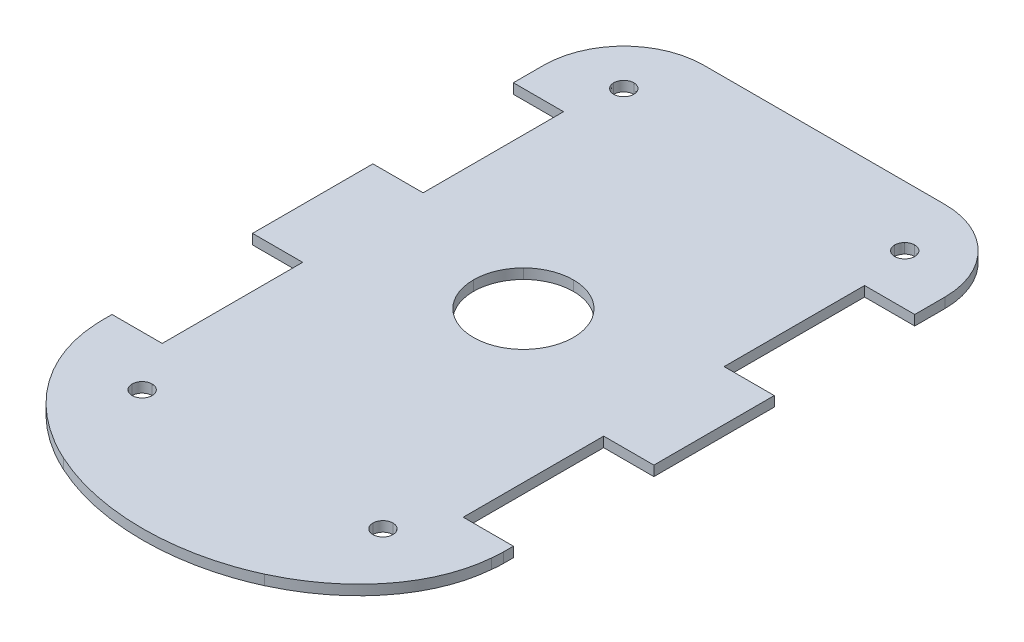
ISO-10303-21;
HEADER;
FILE_DESCRIPTION(('STEP AP214'),'2;1');
FILE_NAME('part.step','',(''),(''),'','','');
FILE_SCHEMA(('AUTOMOTIVE_DESIGN { 1 0 10303 214 1 1 1 1 }'));
ENDSEC;
DATA;
#1=APPLICATION_CONTEXT('core data for automotive mechanical design processes');
#2=APPLICATION_PROTOCOL_DEFINITION('international standard','automotive_design',2000,#1);
#3=PRODUCT_CONTEXT('',#1,'mechanical');
#4=PRODUCT('Part','Part','',(#3));
#5=PRODUCT_RELATED_PRODUCT_CATEGORY('part','',(#4));
#6=PRODUCT_DEFINITION_FORMATION('','',#4);
#7=PRODUCT_DEFINITION_CONTEXT('part definition',#1,'design');
#8=PRODUCT_DEFINITION('design','',#6,#7);
#9=PRODUCT_DEFINITION_SHAPE('','',#8);
#10=(LENGTH_UNIT() NAMED_UNIT(*) SI_UNIT(.MILLI.,.METRE.));
#11=(NAMED_UNIT(*) PLANE_ANGLE_UNIT() SI_UNIT($,.RADIAN.));
#12=(NAMED_UNIT(*) SI_UNIT($,.STERADIAN.) SOLID_ANGLE_UNIT());
#13=UNCERTAINTY_MEASURE_WITH_UNIT(LENGTH_MEASURE(1.E-05),#10,'distance_accuracy_value','');
#14=(GEOMETRIC_REPRESENTATION_CONTEXT(3) GLOBAL_UNCERTAINTY_ASSIGNED_CONTEXT((#13)) GLOBAL_UNIT_ASSIGNED_CONTEXT((#10,
#11,#12)) REPRESENTATION_CONTEXT('',''));
#15=CARTESIAN_POINT('',(0.,0.,0.));
#16=DIRECTION('',(0.,0.,1.));
#17=DIRECTION('',(1.,0.,0.));
#18=AXIS2_PLACEMENT_3D('',#15,#16,#17);
#19=CARTESIAN_POINT('',(61.690124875,5.,-388.310102));
#20=DIRECTION('',(0.,-1.,0.));
#21=DIRECTION('',(0.,0.,-1.));
#22=AXIS2_PLACEMENT_3D('',#19,#20,#21);
#23=PLANE('',#22);
#24=CARTESIAN_POINT('',(90.000189,5.,-124.999932));
#25=CARTESIAN_POINT('',(87.238801,5.,-125.000048));
#26=CARTESIAN_POINT('',(85.000146,5.,-122.761621));
#27=CARTESIAN_POINT('',(84.99998,5.,-120.000233));
#28=B_SPLINE_CURVE_WITH_KNOTS('',3,(#24,#25,#26,#27),.UNSPECIFIED.,.F.,.F.,(4,4),(0.,1.),.UNSPECIFIED.);
#29=CARTESIAN_POINT('',(90.000189,5.,-124.999932));
#30=VERTEX_POINT('',#29);
#31=CARTESIAN_POINT('',(84.99998,5.,-120.000233));
#32=VERTEX_POINT('',#31);
#33=EDGE_CURVE('E473',#30,#32,#28,.T.);
#34=ORIENTED_EDGE('',*,*,#33,.F.);
#35=CARTESIAN_POINT('',(94.999886,5.,-120.000233));
#36=CARTESIAN_POINT('',(94.999719,5.,-122.761421));
#37=CARTESIAN_POINT('',(92.761377,5.,-124.999765));
#38=CARTESIAN_POINT('',(90.000189,5.,-124.999932));
#39=B_SPLINE_CURVE_WITH_KNOTS('',3,(#35,#36,#37,#38),.UNSPECIFIED.,.F.,.F.,(4,4),(0.,1.),.UNSPECIFIED.);
#40=CARTESIAN_POINT('',(94.999886,5.,-120.000233));
#41=VERTEX_POINT('',#40);
#42=EDGE_CURVE('E423',#41,#30,#39,.T.);
#43=ORIENTED_EDGE('',*,*,#42,.F.);
#44=CARTESIAN_POINT('',(90.000189,5.,-115.000005));
#45=CARTESIAN_POINT('',(92.761583,5.,-115.000173));
#46=CARTESIAN_POINT('',(95.000011,5.,-117.238839));
#47=CARTESIAN_POINT('',(94.999886,5.,-120.000233));
#48=B_SPLINE_CURVE_WITH_KNOTS('',3,(#44,#45,#46,#47),.UNSPECIFIED.,.F.,.F.,(4,4),(0.,1.),.UNSPECIFIED.);
#49=CARTESIAN_POINT('',(90.000189,5.,-115.000005));
#50=VERTEX_POINT('',#49);
#51=EDGE_CURVE('E429',#50,#41,#48,.T.);
#52=ORIENTED_EDGE('',*,*,#51,.F.);
#53=CARTESIAN_POINT('',(86.464439,5.,-116.464478));
#54=CARTESIAN_POINT('',(87.402173,5.,-115.526741));
#55=CARTESIAN_POINT('',(88.674031,5.,-114.99995));
#56=CARTESIAN_POINT('',(90.000189,5.,-115.000005));
#57=B_SPLINE_CURVE_WITH_KNOTS('',3,(#53,#54,#55,#56),.UNSPECIFIED.,.F.,.F.,(4,4),(0.,1.),.UNSPECIFIED.);
#58=CARTESIAN_POINT('',(86.464439,5.,-116.464478));
#59=VERTEX_POINT('',#58);
#60=EDGE_CURVE('E1732',#59,#50,#57,.T.);
#61=ORIENTED_EDGE('',*,*,#60,.F.);
#62=CARTESIAN_POINT('',(84.99998,5.,-120.000233));
#63=CARTESIAN_POINT('',(84.999919,5.,-118.674075));
#64=CARTESIAN_POINT('',(85.526706,5.,-117.402215));
#65=CARTESIAN_POINT('',(86.464439,5.,-116.464478));
#66=B_SPLINE_CURVE_WITH_KNOTS('',3,(#62,#63,#64,#65),.UNSPECIFIED.,.F.,.F.,(4,4),(0.,1.),.UNSPECIFIED.);
#67=EDGE_CURVE('E1178',#32,#59,#66,.T.);
#68=ORIENTED_EDGE('',*,*,#67,.F.);
#69=EDGE_LOOP('',(#34,#43,#52,#61,#68));
#70=FACE_BOUND('',#69,.T.);
#71=CARTESIAN_POINT('',(220.000004,5.,-375.000165));
#72=CARTESIAN_POINT('',(218.673849,5.,-375.00022));
#73=CARTESIAN_POINT('',(217.401993,5.,-374.473431));
#74=CARTESIAN_POINT('',(216.46426,5.,-373.535698));
#75=B_SPLINE_CURVE_WITH_KNOTS('',3,(#71,#72,#73,#74),.UNSPECIFIED.,.F.,.F.,(4,4),(0.,1.),.UNSPECIFIED.);
#76=CARTESIAN_POINT('',(220.000004,5.,-375.000165));
#77=VERTEX_POINT('',#76);
#78=CARTESIAN_POINT('',(216.46426,5.,-373.535698));
#79=VERTEX_POINT('',#78);
#80=EDGE_CURVE('E579',#77,#79,#75,.T.);
#81=ORIENTED_EDGE('',*,*,#80,.F.);
#82=CARTESIAN_POINT('',(223.53575,5.,-373.535699));
#83=CARTESIAN_POINT('',(222.598017,5.,-374.473432));
#84=CARTESIAN_POINT('',(221.32616,5.,-375.000221));
#85=CARTESIAN_POINT('',(220.000004,5.,-375.000165));
#86=B_SPLINE_CURVE_WITH_KNOTS('',3,(#82,#83,#84,#85),.UNSPECIFIED.,.F.,.F.,(4,4),(0.,1.),.UNSPECIFIED.);
#87=CARTESIAN_POINT('',(223.53575,5.,-373.535699));
#88=VERTEX_POINT('',#87);
#89=EDGE_CURVE('E519',#88,#77,#86,.T.);
#90=ORIENTED_EDGE('',*,*,#89,.F.);
#91=CARTESIAN_POINT('',(225.000217,5.,-369.999952));
#92=CARTESIAN_POINT('',(225.000273,5.,-371.326108));
#93=CARTESIAN_POINT('',(224.473484,5.,-372.597965));
#94=CARTESIAN_POINT('',(223.53575,5.,-373.535699));
#95=B_SPLINE_CURVE_WITH_KNOTS('',3,(#91,#92,#93,#94),.UNSPECIFIED.,.F.,.F.,(4,4),(0.,1.),.UNSPECIFIED.);
#96=CARTESIAN_POINT('',(225.000217,5.,-369.999952));
#97=VERTEX_POINT('',#96);
#98=EDGE_CURVE('E525',#97,#88,#95,.T.);
#99=ORIENTED_EDGE('',*,*,#98,.F.);
#100=CARTESIAN_POINT('',(220.000004,5.,-365.000256));
#101=CARTESIAN_POINT('',(222.761392,5.,-365.000139));
#102=CARTESIAN_POINT('',(225.000049,5.,-367.238564));
#103=CARTESIAN_POINT('',(225.000217,5.,-369.999952));
#104=B_SPLINE_CURVE_WITH_KNOTS('',3,(#100,#101,#102,#103),.UNSPECIFIED.,.F.,.F.,(4,4),(0.,1.),.UNSPECIFIED.);
#105=CARTESIAN_POINT('',(220.000004,5.,-365.000256));
#106=VERTEX_POINT('',#105);
#107=EDGE_CURVE('E1297',#106,#97,#104,.T.);
#108=ORIENTED_EDGE('',*,*,#107,.F.);
#109=CARTESIAN_POINT('',(214.999795,5.,-369.999952));
#110=CARTESIAN_POINT('',(214.999963,5.,-367.238566));
#111=CARTESIAN_POINT('',(217.238617,5.,-365.00014));
#112=CARTESIAN_POINT('',(220.000004,5.,-365.000256));
#113=B_SPLINE_CURVE_WITH_KNOTS('',3,(#109,#110,#111,#112),.UNSPECIFIED.,.F.,.F.,(4,4),(0.,1.),.UNSPECIFIED.);
#114=CARTESIAN_POINT('',(214.999795,5.,-369.999952));
#115=VERTEX_POINT('',#114);
#116=EDGE_CURVE('E1280',#115,#106,#113,.T.);
#117=ORIENTED_EDGE('',*,*,#116,.F.);
#118=CARTESIAN_POINT('',(216.46426,5.,-373.535698));
#119=CARTESIAN_POINT('',(215.526527,5.,-372.597964));
#120=CARTESIAN_POINT('',(214.999739,5.,-371.326108));
#121=CARTESIAN_POINT('',(214.999795,5.,-369.999952));
#122=B_SPLINE_CURVE_WITH_KNOTS('',3,(#118,#119,#120,#121),.UNSPECIFIED.,.F.,.F.,(4,4),(0.,1.),.UNSPECIFIED.);
#123=EDGE_CURVE('E1272',#79,#115,#122,.T.);
#124=ORIENTED_EDGE('',*,*,#123,.F.);
#125=EDGE_LOOP('',(#81,#90,#99,#108,#117,#124));
#126=FACE_BOUND('',#125,.T.);
#127=CARTESIAN_POINT('',(90.000189,5.,-400.000187));
#128=CARTESIAN_POINT('',(67.840206,5.,-400.000187));
#129=CARTESIAN_POINT('',(50.000048,5.,-382.160007));
#130=CARTESIAN_POINT('',(50.000048,5.,-360.000047));
#131=B_SPLINE_CURVE_WITH_KNOTS('',3,(#127,#128,#129,#130),.UNSPECIFIED.,.F.,.F.,(4,4),(0.,1.),.UNSPECIFIED.);
#132=CARTESIAN_POINT('',(90.000189,5.,-400.000187));
#133=VERTEX_POINT('',#132);
#134=CARTESIAN_POINT('',(50.000048,5.,-360.000047));
#135=VERTEX_POINT('',#134);
#136=EDGE_CURVE('E740',#133,#135,#131,.T.);
#137=ORIENTED_EDGE('',*,*,#136,.T.);
#138=DIRECTION('',(0.,0.,1.));
#139=VECTOR('',#138,1.);
#140=CARTESIAN_POINT('',(50.000048,5.,-360.000047));
#141=LINE('',#140,#139);
#142=CARTESIAN_POINT('',(50.000048,5.,-344.999929));
#143=VERTEX_POINT('',#142);
#144=EDGE_CURVE('E904',#135,#143,#141,.T.);
#145=ORIENTED_EDGE('',*,*,#144,.T.);
#146=DIRECTION('',(1.,0.,0.));
#147=VECTOR('',#146,1.);
#148=CARTESIAN_POINT('',(50.000048,5.,-344.999929));
#149=LINE('',#148,#147);
#150=CARTESIAN_POINT('',(75.000071,5.,-344.999929));
#151=VERTEX_POINT('',#150);
#152=EDGE_CURVE('E818',#143,#151,#149,.T.);
#153=ORIENTED_EDGE('',*,*,#152,.T.);
#154=DIRECTION('',(0.,0.,1.));
#155=VECTOR('',#154,1.);
#156=CARTESIAN_POINT('',(75.000071,5.,-344.999929));
#157=LINE('',#156,#155);
#158=CARTESIAN_POINT('',(75.000071,5.,-275.000067));
#159=VERTEX_POINT('',#158);
#160=EDGE_CURVE('E837',#151,#159,#157,.T.);
#161=ORIENTED_EDGE('',*,*,#160,.T.);
#162=DIRECTION('',(-1.,0.,0.));
#163=VECTOR('',#162,1.);
#164=CARTESIAN_POINT('',(75.000071,5.,-275.000067));
#165=LINE('',#164,#163);
#166=CARTESIAN_POINT('',(50.000048,5.,-275.000067));
#167=VERTEX_POINT('',#166);
#168=EDGE_CURVE('E833',#159,#167,#165,.T.);
#169=ORIENTED_EDGE('',*,*,#168,.T.);
#170=DIRECTION('',(0.,0.,1.));
#171=VECTOR('',#170,1.);
#172=CARTESIAN_POINT('',(50.000048,5.,-275.000067));
#173=LINE('',#172,#171);
#174=CARTESIAN_POINT('',(50.000048,5.,-215.000114));
#175=VERTEX_POINT('',#174);
#176=EDGE_CURVE('E836',#167,#175,#173,.T.);
#177=ORIENTED_EDGE('',*,*,#176,.T.);
#178=DIRECTION('',(1.,0.,0.));
#179=VECTOR('',#178,1.);
#180=CARTESIAN_POINT('',(50.000048,5.,-215.000114));
#181=LINE('',#180,#179);
#182=CARTESIAN_POINT('',(75.000071,5.,-215.000114));
#183=VERTEX_POINT('',#182);
#184=EDGE_CURVE('E839',#175,#183,#181,.T.);
#185=ORIENTED_EDGE('',*,*,#184,.T.);
#186=DIRECTION('',(0.,0.,1.));
#187=VECTOR('',#186,1.);
#188=CARTESIAN_POINT('',(75.000071,5.,-215.000114));
#189=LINE('',#188,#187);
#190=CARTESIAN_POINT('',(75.000071,5.,-145.000262));
#191=VERTEX_POINT('',#190);
#192=EDGE_CURVE('E845',#183,#191,#189,.T.);
#193=ORIENTED_EDGE('',*,*,#192,.T.);
#194=DIRECTION('',(-1.,0.,0.));
#195=VECTOR('',#194,1.);
#196=CARTESIAN_POINT('',(75.000071,5.,-145.000262));
#197=LINE('',#196,#195);
#198=CARTESIAN_POINT('',(50.000048,5.,-145.000262));
#199=VERTEX_POINT('',#198);
#200=EDGE_CURVE('E847',#191,#199,#197,.T.);
#201=ORIENTED_EDGE('',*,*,#200,.T.);
#202=DIRECTION('',(0.,0.,1.));
#203=VECTOR('',#202,1.);
#204=CARTESIAN_POINT('',(50.000048,5.,-145.000262));
#205=LINE('',#204,#203);
#206=CARTESIAN_POINT('',(50.000048,5.,-140.000034));
#207=VERTEX_POINT('',#206);
#208=EDGE_CURVE('E849',#199,#207,#205,.T.);
#209=ORIENTED_EDGE('',*,*,#208,.T.);
#210=CARTESIAN_POINT('',(50.000048,5.,-140.000034));
#211=CARTESIAN_POINT('',(50.000048,5.,-139.033062));
#212=CARTESIAN_POINT('',(50.036068,5.,-138.074688));
#213=CARTESIAN_POINT('',(50.102883,5.,-137.125284));
#214=B_SPLINE_CURVE_WITH_KNOTS('',3,(#210,#211,#212,#213),.UNSPECIFIED.,.F.,.F.,(4,4),(0.,1.),.UNSPECIFIED.);
#215=CARTESIAN_POINT('',(50.102883,5.,-137.125284));
#216=VERTEX_POINT('',#215);
#217=EDGE_CURVE('E851',#207,#216,#214,.T.);
#218=ORIENTED_EDGE('',*,*,#217,.T.);
#219=CARTESIAN_POINT('',(50.102883,5.,-137.125284));
#220=CARTESIAN_POINT('',(51.340476,5.,-109.663561));
#221=CARTESIAN_POINT('',(70.194379,5.,-84.642167));
#222=CARTESIAN_POINT('',(100.006815,5.,-70.896769));
#223=B_SPLINE_CURVE_WITH_KNOTS('',3,(#219,#220,#221,#222),.UNSPECIFIED.,.F.,.F.,(4,4),(0.,1.),.UNSPECIFIED.);
#224=CARTESIAN_POINT('',(100.006815,5.,-70.896769));
#225=VERTEX_POINT('',#224);
#226=EDGE_CURVE('E856',#216,#225,#223,.T.);
#227=ORIENTED_EDGE('',*,*,#226,.T.);
#228=CARTESIAN_POINT('',(100.006815,5.,-70.896769));
#229=CARTESIAN_POINT('',(130.94023,5.,-56.642331));
#230=CARTESIAN_POINT('',(169.051792,5.,-56.642331));
#231=CARTESIAN_POINT('',(199.985207,5.,-70.896769));
#232=B_SPLINE_CURVE_WITH_KNOTS('',3,(#228,#229,#230,#231),.UNSPECIFIED.,.F.,.F.,(4,4),(0.,1.),.UNSPECIFIED.);
#233=CARTESIAN_POINT('',(199.985207,5.,-70.896769));
#234=VERTEX_POINT('',#233);
#235=EDGE_CURVE('E983',#225,#234,#232,.T.);
#236=ORIENTED_EDGE('',*,*,#235,.T.);
#237=CARTESIAN_POINT('',(199.985207,5.,-70.896769));
#238=CARTESIAN_POINT('',(228.771136,5.,-84.201559));
#239=CARTESIAN_POINT('',(247.381121,5.,-108.061961));
#240=CARTESIAN_POINT('',(249.632305,5.,-134.550755));
#241=B_SPLINE_CURVE_WITH_KNOTS('',3,(#237,#238,#239,#240),.UNSPECIFIED.,.F.,.F.,(4,4),(0.,1.),.UNSPECIFIED.);
#242=CARTESIAN_POINT('',(249.632305,5.,-134.550755));
#243=VERTEX_POINT('',#242);
#244=EDGE_CURVE('E979',#234,#243,#241,.T.);
#245=ORIENTED_EDGE('',*,*,#244,.T.);
#246=CARTESIAN_POINT('',(249.632305,5.,-134.550755));
#247=CARTESIAN_POINT('',(249.872963,5.,-136.332142));
#248=CARTESIAN_POINT('',(250.00024,5.,-138.150623));
#249=CARTESIAN_POINT('',(250.00024,5.,-140.000034));
#250=B_SPLINE_CURVE_WITH_KNOTS('',3,(#246,#247,#248,#249),.UNSPECIFIED.,.F.,.F.,(4,4),(0.,1.),.UNSPECIFIED.);
#251=CARTESIAN_POINT('',(250.00024,5.,-140.000034));
#252=VERTEX_POINT('',#251);
#253=EDGE_CURVE('E970',#243,#252,#250,.T.);
#254=ORIENTED_EDGE('',*,*,#253,.T.);
#255=DIRECTION('',(0.,0.,-1.));
#256=VECTOR('',#255,1.);
#257=CARTESIAN_POINT('',(250.00024,5.,-140.000034));
#258=LINE('',#257,#256);
#259=CARTESIAN_POINT('',(250.00024,5.,-144.999733));
#260=VERTEX_POINT('',#259);
#261=EDGE_CURVE('E965',#252,#260,#258,.T.);
#262=ORIENTED_EDGE('',*,*,#261,.T.);
#263=DIRECTION('',(-1.,0.,0.));
#264=VECTOR('',#263,1.);
#265=CARTESIAN_POINT('',(250.00024,5.,-144.999733));
#266=LINE('',#265,#264);
#267=CARTESIAN_POINT('',(225.000217,5.,-144.999733));
#268=VERTEX_POINT('',#267);
#269=EDGE_CURVE('E961',#260,#268,#266,.T.);
#270=ORIENTED_EDGE('',*,*,#269,.T.);
#271=DIRECTION('',(0.,0.,-1.));
#272=VECTOR('',#271,1.);
#273=CARTESIAN_POINT('',(225.000217,5.,-144.999733));
#274=LINE('',#273,#272);
#275=CARTESIAN_POINT('',(225.000217,5.,-215.000114));
#276=VERTEX_POINT('',#275);
#277=EDGE_CURVE('E952',#268,#276,#274,.T.);
#278=ORIENTED_EDGE('',*,*,#277,.T.);
#279=DIRECTION('',(1.,0.,0.));
#280=VECTOR('',#279,1.);
#281=CARTESIAN_POINT('',(225.000217,5.,-215.000114));
#282=LINE('',#281,#280);
#283=CARTESIAN_POINT('',(250.00024,5.,-215.000114));
#284=VERTEX_POINT('',#283);
#285=EDGE_CURVE('E947',#276,#284,#282,.T.);
#286=ORIENTED_EDGE('',*,*,#285,.T.);
#287=DIRECTION('',(0.,0.,-1.));
#288=VECTOR('',#287,1.);
#289=CARTESIAN_POINT('',(250.00024,5.,-215.000114));
#290=LINE('',#289,#288);
#291=CARTESIAN_POINT('',(250.00024,5.,-275.000067));
#292=VERTEX_POINT('',#291);
#293=EDGE_CURVE('E943',#284,#292,#290,.T.);
#294=ORIENTED_EDGE('',*,*,#293,.T.);
#295=DIRECTION('',(-1.,0.,0.));
#296=VECTOR('',#295,1.);
#297=CARTESIAN_POINT('',(250.00024,5.,-275.000067));
#298=LINE('',#297,#296);
#299=CARTESIAN_POINT('',(225.000217,5.,-275.000067));
#300=VERTEX_POINT('',#299);
#301=EDGE_CURVE('E934',#292,#300,#298,.T.);
#302=ORIENTED_EDGE('',*,*,#301,.T.);
#303=DIRECTION('',(0.,0.,-1.));
#304=VECTOR('',#303,1.);
#305=CARTESIAN_POINT('',(225.000217,5.,-275.000067));
#306=LINE('',#305,#304);
#307=CARTESIAN_POINT('',(225.000217,5.,-344.999929));
#308=VERTEX_POINT('',#307);
#309=EDGE_CURVE('E929',#300,#308,#306,.T.);
#310=ORIENTED_EDGE('',*,*,#309,.T.);
#311=DIRECTION('',(1.,0.,0.));
#312=VECTOR('',#311,1.);
#313=CARTESIAN_POINT('',(225.000217,5.,-344.999929));
#314=LINE('',#313,#312);
#315=CARTESIAN_POINT('',(250.00024,5.,-344.999929));
#316=VERTEX_POINT('',#315);
#317=EDGE_CURVE('E925',#308,#316,#314,.T.);
#318=ORIENTED_EDGE('',*,*,#317,.T.);
#319=DIRECTION('',(0.,0.,-1.));
#320=VECTOR('',#319,1.);
#321=CARTESIAN_POINT('',(250.00024,5.,-344.999929));
#322=LINE('',#321,#320);
#323=CARTESIAN_POINT('',(250.00024,5.,-360.000047));
#324=VERTEX_POINT('',#323);
#325=EDGE_CURVE('E644',#316,#324,#322,.T.);
#326=ORIENTED_EDGE('',*,*,#325,.T.);
#327=CARTESIAN_POINT('',(250.00024,5.,-360.000047));
#328=CARTESIAN_POINT('',(250.00024,5.,-382.160007));
#329=CARTESIAN_POINT('',(232.160085,5.,-400.000187));
#330=CARTESIAN_POINT('',(210.000099,5.,-400.000187));
#331=B_SPLINE_CURVE_WITH_KNOTS('',3,(#327,#328,#329,#330),.UNSPECIFIED.,.F.,.F.,(4,4),(0.,1.),.UNSPECIFIED.);
#332=CARTESIAN_POINT('',(210.000099,5.,-400.000187));
#333=VERTEX_POINT('',#332);
#334=EDGE_CURVE('E637',#324,#333,#331,.T.);
#335=ORIENTED_EDGE('',*,*,#334,.T.);
#336=DIRECTION('',(-1.,0.,0.));
#337=VECTOR('',#336,1.);
#338=CARTESIAN_POINT('',(210.000099,5.,-400.000187));
#339=LINE('',#338,#337);
#340=EDGE_CURVE('E643',#333,#133,#339,.T.);
#341=ORIENTED_EDGE('',*,*,#340,.T.);
#342=EDGE_LOOP('',(#137,#145,#153,#161,#169,#177,#185,#193,#201,#209,#218,#227,#236,#245,#254,
#262,#270,#278,#286,#294,#302,#310,#318,#326,#335,#341));
#343=FACE_BOUND('',#342,.T.);
#344=CARTESIAN_POINT('',(79.999768,5.,-375.000165));
#345=CARTESIAN_POINT('',(77.23838,5.,-374.999997));
#346=CARTESIAN_POINT('',(74.999954,5.,-372.76134));
#347=CARTESIAN_POINT('',(75.000071,5.,-369.999952));
#348=B_SPLINE_CURVE_WITH_KNOTS('',3,(#344,#345,#346,#347),.UNSPECIFIED.,.F.,.F.,(4,4),(0.,1.),.UNSPECIFIED.);
#349=CARTESIAN_POINT('',(79.999768,5.,-375.000165));
#350=VERTEX_POINT('',#349);
#351=CARTESIAN_POINT('',(75.000071,5.,-369.999952));
#352=VERTEX_POINT('',#351);
#353=EDGE_CURVE('E597',#350,#352,#348,.T.);
#354=ORIENTED_EDGE('',*,*,#353,.F.);
#355=CARTESIAN_POINT('',(83.535514,5.,-373.535699));
#356=CARTESIAN_POINT('',(82.59778,5.,-374.473432));
#357=CARTESIAN_POINT('',(81.325924,5.,-375.000221));
#358=CARTESIAN_POINT('',(79.999768,5.,-375.000165));
#359=B_SPLINE_CURVE_WITH_KNOTS('',3,(#355,#356,#357,#358),.UNSPECIFIED.,.F.,.F.,(4,4),(0.,1.),.UNSPECIFIED.);
#360=CARTESIAN_POINT('',(83.535514,5.,-373.535699));
#361=VERTEX_POINT('',#360);
#362=EDGE_CURVE('E1054',#361,#350,#359,.T.);
#363=ORIENTED_EDGE('',*,*,#362,.F.);
#364=CARTESIAN_POINT('',(84.99998,5.,-369.999952));
#365=CARTESIAN_POINT('',(85.000036,5.,-371.326108));
#366=CARTESIAN_POINT('',(84.473248,5.,-372.597965));
#367=CARTESIAN_POINT('',(83.535514,5.,-373.535699));
#368=B_SPLINE_CURVE_WITH_KNOTS('',3,(#364,#365,#366,#367),.UNSPECIFIED.,.F.,.F.,(4,4),(0.,1.),.UNSPECIFIED.);
#369=CARTESIAN_POINT('',(84.99998,5.,-369.999952));
#370=VERTEX_POINT('',#369);
#371=EDGE_CURVE('E1097',#370,#361,#368,.T.);
#372=ORIENTED_EDGE('',*,*,#371,.F.);
#373=CARTESIAN_POINT('',(79.999768,5.,-365.000256));
#374=CARTESIAN_POINT('',(82.761156,5.,-365.000139));
#375=CARTESIAN_POINT('',(84.999812,5.,-367.238564));
#376=CARTESIAN_POINT('',(84.99998,5.,-369.999952));
#377=B_SPLINE_CURVE_WITH_KNOTS('',3,(#373,#374,#375,#376),.UNSPECIFIED.,.F.,.F.,(4,4),(0.,1.),.UNSPECIFIED.);
#378=CARTESIAN_POINT('',(79.999768,5.,-365.000256));
#379=VERTEX_POINT('',#378);
#380=EDGE_CURVE('E1119',#379,#370,#377,.T.);
#381=ORIENTED_EDGE('',*,*,#380,.F.);
#382=CARTESIAN_POINT('',(75.000071,5.,-369.999952));
#383=CARTESIAN_POINT('',(75.000239,5.,-367.238766));
#384=CARTESIAN_POINT('',(77.238581,5.,-365.000424));
#385=CARTESIAN_POINT('',(79.999768,5.,-365.000256));
#386=B_SPLINE_CURVE_WITH_KNOTS('',3,(#382,#383,#384,#385),.UNSPECIFIED.,.F.,.F.,(4,4),(0.,1.),.UNSPECIFIED.);
#387=EDGE_CURVE('E602',#352,#379,#386,.T.);
#388=ORIENTED_EDGE('',*,*,#387,.F.);
#389=EDGE_LOOP('',(#354,#363,#372,#381,#388));
#390=FACE_BOUND('',#389,.T.);
#391=CARTESIAN_POINT('',(150.000145,5.,-274.87966));
#392=CARTESIAN_POINT('',(143.401588,5.,-274.879751));
#393=CARTESIAN_POINT('',(137.073256,5.,-272.25856));
#394=CARTESIAN_POINT('',(132.407321,5.,-267.592722));
#395=B_SPLINE_CURVE_WITH_KNOTS('',3,(#391,#392,#393,#394),.UNSPECIFIED.,.F.,.F.,(4,4),(0.,1.),.UNSPECIFIED.);
#396=CARTESIAN_POINT('',(150.000145,5.,-274.87966));
#397=VERTEX_POINT('',#396);
#398=CARTESIAN_POINT('',(132.407321,5.,-267.592722));
#399=VERTEX_POINT('',#398);
#400=EDGE_CURVE('E489',#397,#399,#395,.T.);
#401=ORIENTED_EDGE('',*,*,#400,.F.);
#402=CARTESIAN_POINT('',(174.879762,5.,-250.000043));
#403=CARTESIAN_POINT('',(174.879657,5.,-263.740639));
#404=CARTESIAN_POINT('',(163.740732,5.,-274.879563));
#405=CARTESIAN_POINT('',(150.000145,5.,-274.87966));
#406=B_SPLINE_CURVE_WITH_KNOTS('',3,(#402,#403,#404,#405),.UNSPECIFIED.,.F.,.F.,(4,4),(0.,1.),.UNSPECIFIED.);
#407=CARTESIAN_POINT('',(174.879762,5.,-250.000043));
#408=VERTEX_POINT('',#407);
#409=EDGE_CURVE('E1200',#408,#397,#406,.T.);
#410=ORIENTED_EDGE('',*,*,#409,.F.);
#411=CARTESIAN_POINT('',(150.000145,5.,-225.120426));
#412=CARTESIAN_POINT('',(163.740732,5.,-225.120523));
#413=CARTESIAN_POINT('',(174.879657,5.,-236.259448));
#414=CARTESIAN_POINT('',(174.879762,5.,-250.000043));
#415=B_SPLINE_CURVE_WITH_KNOTS('',3,(#411,#412,#413,#414),.UNSPECIFIED.,.F.,.F.,(4,4),(0.,1.),.UNSPECIFIED.);
#416=CARTESIAN_POINT('',(150.000145,5.,-225.120426));
#417=VERTEX_POINT('',#416);
#418=EDGE_CURVE('E1206',#417,#408,#415,.T.);
#419=ORIENTED_EDGE('',*,*,#418,.F.);
#420=CARTESIAN_POINT('',(132.407321,5.,-232.407364));
#421=CARTESIAN_POINT('',(137.073256,5.,-227.741527));
#422=CARTESIAN_POINT('',(143.401588,5.,-225.120335));
#423=CARTESIAN_POINT('',(150.000145,5.,-225.120426));
#424=B_SPLINE_CURVE_WITH_KNOTS('',3,(#420,#421,#422,#423),.UNSPECIFIED.,.F.,.F.,(4,4),(0.,1.),.UNSPECIFIED.);
#425=CARTESIAN_POINT('',(132.407321,5.,-232.407364));
#426=VERTEX_POINT('',#425);
#427=EDGE_CURVE('E1752',#426,#417,#424,.T.);
#428=ORIENTED_EDGE('',*,*,#427,.F.);
#429=CARTESIAN_POINT('',(125.120009,5.,-250.000043));
#430=CARTESIAN_POINT('',(125.12006,5.,-243.401481));
#431=CARTESIAN_POINT('',(127.741386,5.,-237.073202));
#432=CARTESIAN_POINT('',(132.407321,5.,-232.407364));
#433=B_SPLINE_CURVE_WITH_KNOTS('',3,(#429,#430,#431,#432),.UNSPECIFIED.,.F.,.F.,(4,4),(0.,1.),.UNSPECIFIED.);
#434=CARTESIAN_POINT('',(125.120009,5.,-250.000043));
#435=VERTEX_POINT('',#434);
#436=EDGE_CURVE('E1754',#435,#426,#433,.T.);
#437=ORIENTED_EDGE('',*,*,#436,.F.);
#438=CARTESIAN_POINT('',(132.407321,5.,-267.592722));
#439=CARTESIAN_POINT('',(127.741386,5.,-262.926884));
#440=CARTESIAN_POINT('',(125.12006,5.,-256.598605));
#441=CARTESIAN_POINT('',(125.120009,5.,-250.000043));
#442=B_SPLINE_CURVE_WITH_KNOTS('',3,(#438,#439,#440,#441),.UNSPECIFIED.,.F.,.F.,(4,4),(0.,1.),.UNSPECIFIED.);
#443=EDGE_CURVE('E494',#399,#435,#442,.T.);
#444=ORIENTED_EDGE('',*,*,#443,.F.);
#445=EDGE_LOOP('',(#401,#410,#419,#428,#437,#444));
#446=FACE_BOUND('',#445,.T.);
#447=CARTESIAN_POINT('',(210.000099,5.,-124.999932));
#448=CARTESIAN_POINT('',(207.23871,5.,-125.000049));
#449=CARTESIAN_POINT('',(205.000053,5.,-122.761622));
#450=CARTESIAN_POINT('',(204.999886,5.,-120.000233));
#451=B_SPLINE_CURVE_WITH_KNOTS('',3,(#447,#448,#449,#450),.UNSPECIFIED.,.F.,.F.,(4,4),(0.,1.),.UNSPECIFIED.);
#452=CARTESIAN_POINT('',(210.000099,5.,-124.999932));
#453=VERTEX_POINT('',#452);
#454=CARTESIAN_POINT('',(204.999886,5.,-120.000233));
#455=VERTEX_POINT('',#454);
#456=EDGE_CURVE('E369',#453,#455,#451,.T.);
#457=ORIENTED_EDGE('',*,*,#456,.F.);
#458=CARTESIAN_POINT('',(214.999795,5.,-120.000233));
#459=CARTESIAN_POINT('',(214.999629,5.,-122.761421));
#460=CARTESIAN_POINT('',(212.761286,5.,-124.999765));
#461=CARTESIAN_POINT('',(210.000099,5.,-124.999932));
#462=B_SPLINE_CURVE_WITH_KNOTS('',3,(#458,#459,#460,#461),.UNSPECIFIED.,.F.,.F.,(4,4),(0.,1.),.UNSPECIFIED.);
#463=CARTESIAN_POINT('',(214.999795,5.,-120.000233));
#464=VERTEX_POINT('',#463);
#465=EDGE_CURVE('E1169',#464,#453,#462,.T.);
#466=ORIENTED_EDGE('',*,*,#465,.F.);
#467=CARTESIAN_POINT('',(210.000099,5.,-115.000005));
#468=CARTESIAN_POINT('',(212.761493,5.,-115.000173));
#469=CARTESIAN_POINT('',(214.999921,5.,-117.238839));
#470=CARTESIAN_POINT('',(214.999795,5.,-120.000233));
#471=B_SPLINE_CURVE_WITH_KNOTS('',3,(#467,#468,#469,#470),.UNSPECIFIED.,.F.,.F.,(4,4),(0.,1.),.UNSPECIFIED.);
#472=CARTESIAN_POINT('',(210.000099,5.,-115.000005));
#473=VERTEX_POINT('',#472);
#474=EDGE_CURVE('E392',#473,#464,#471,.T.);
#475=ORIENTED_EDGE('',*,*,#474,.F.);
#476=CARTESIAN_POINT('',(206.464347,5.,-116.464477));
#477=CARTESIAN_POINT('',(207.402081,5.,-115.52674));
#478=CARTESIAN_POINT('',(208.67394,5.,-114.999949));
#479=CARTESIAN_POINT('',(210.000099,5.,-115.000005));
#480=B_SPLINE_CURVE_WITH_KNOTS('',3,(#476,#477,#478,#479),.UNSPECIFIED.,.F.,.F.,(4,4),(0.,1.),.UNSPECIFIED.);
#481=CARTESIAN_POINT('',(206.464347,5.,-116.464477));
#482=VERTEX_POINT('',#481);
#483=EDGE_CURVE('E390',#482,#473,#480,.T.);
#484=ORIENTED_EDGE('',*,*,#483,.F.);
#485=CARTESIAN_POINT('',(204.999886,5.,-120.000233));
#486=CARTESIAN_POINT('',(204.999826,5.,-118.674075));
#487=CARTESIAN_POINT('',(205.526613,5.,-117.402214));
#488=CARTESIAN_POINT('',(206.464347,5.,-116.464477));
#489=B_SPLINE_CURVE_WITH_KNOTS('',3,(#485,#486,#487,#488),.UNSPECIFIED.,.F.,.F.,(4,4),(0.,1.),.UNSPECIFIED.);
#490=EDGE_CURVE('E377',#455,#482,#489,.T.);
#491=ORIENTED_EDGE('',*,*,#490,.F.);
#492=EDGE_LOOP('',(#457,#466,#475,#484,#491));
#493=FACE_BOUND('',#492,.T.);
#494=ADVANCED_FACE('F33',(#70,#126,#343,#390,#446,#493),#23,.F.);
#495=CARTESIAN_POINT('',(61.690124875,0.,-388.310102));
#496=DIRECTION('',(0.,-1.,0.));
#497=DIRECTION('',(0.,0.,-1.));
#498=AXIS2_PLACEMENT_3D('',#495,#496,#497);
#499=PLANE('',#498);
#500=CARTESIAN_POINT('',(90.000189,0.,-400.000187));
#501=CARTESIAN_POINT('',(67.840206,0.,-400.000187));
#502=CARTESIAN_POINT('',(50.000048,0.,-382.160007));
#503=CARTESIAN_POINT('',(50.000048,0.,-360.000047));
#504=B_SPLINE_CURVE_WITH_KNOTS('',3,(#500,#501,#502,#503),.UNSPECIFIED.,.F.,.F.,(4,4),(0.,1.),.UNSPECIFIED.);
#505=CARTESIAN_POINT('',(90.000189,0.,-400.000187));
#506=VERTEX_POINT('',#505);
#507=CARTESIAN_POINT('',(50.000048,0.,-360.000047));
#508=VERTEX_POINT('',#507);
#509=EDGE_CURVE('E651',#506,#508,#504,.T.);
#510=ORIENTED_EDGE('',*,*,#509,.F.);
#511=DIRECTION('',(-1.,0.,0.));
#512=VECTOR('',#511,1.);
#513=CARTESIAN_POINT('',(210.000099,0.,-400.000187));
#514=LINE('',#513,#512);
#515=CARTESIAN_POINT('',(210.000099,0.,-400.000187));
#516=VERTEX_POINT('',#515);
#517=EDGE_CURVE('E735',#516,#506,#514,.T.);
#518=ORIENTED_EDGE('',*,*,#517,.F.);
#519=CARTESIAN_POINT('',(250.00024,0.,-360.000047));
#520=CARTESIAN_POINT('',(250.00024,0.,-382.160007));
#521=CARTESIAN_POINT('',(232.160085,0.,-400.000187));
#522=CARTESIAN_POINT('',(210.000099,0.,-400.000187));
#523=B_SPLINE_CURVE_WITH_KNOTS('',3,(#519,#520,#521,#522),.UNSPECIFIED.,.F.,.F.,(4,4),(0.,1.),.UNSPECIFIED.);
#524=CARTESIAN_POINT('',(250.00024,0.,-360.000047));
#525=VERTEX_POINT('',#524);
#526=EDGE_CURVE('E731',#525,#516,#523,.T.);
#527=ORIENTED_EDGE('',*,*,#526,.F.);
#528=DIRECTION('',(0.,0.,-1.));
#529=VECTOR('',#528,1.);
#530=CARTESIAN_POINT('',(250.00024,0.,-344.999929));
#531=LINE('',#530,#529);
#532=CARTESIAN_POINT('',(250.00024,0.,-344.999929));
#533=VERTEX_POINT('',#532);
#534=EDGE_CURVE('E729',#533,#525,#531,.T.);
#535=ORIENTED_EDGE('',*,*,#534,.F.);
#536=DIRECTION('',(1.,0.,0.));
#537=VECTOR('',#536,1.);
#538=CARTESIAN_POINT('',(225.000217,0.,-344.999929));
#539=LINE('',#538,#537);
#540=CARTESIAN_POINT('',(225.000217,0.,-344.999929));
#541=VERTEX_POINT('',#540);
#542=EDGE_CURVE('E727',#541,#533,#539,.T.);
#543=ORIENTED_EDGE('',*,*,#542,.F.);
#544=DIRECTION('',(0.,0.,-1.));
#545=VECTOR('',#544,1.);
#546=CARTESIAN_POINT('',(225.000217,0.,-275.000067));
#547=LINE('',#546,#545);
#548=CARTESIAN_POINT('',(225.000217,0.,-275.000067));
#549=VERTEX_POINT('',#548);
#550=EDGE_CURVE('E725',#549,#541,#547,.T.);
#551=ORIENTED_EDGE('',*,*,#550,.F.);
#552=DIRECTION('',(-1.,0.,0.));
#553=VECTOR('',#552,1.);
#554=CARTESIAN_POINT('',(250.00024,0.,-275.000067));
#555=LINE('',#554,#553);
#556=CARTESIAN_POINT('',(250.00024,0.,-275.000067));
#557=VERTEX_POINT('',#556);
#558=EDGE_CURVE('E723',#557,#549,#555,.T.);
#559=ORIENTED_EDGE('',*,*,#558,.F.);
#560=DIRECTION('',(0.,0.,-1.));
#561=VECTOR('',#560,1.);
#562=CARTESIAN_POINT('',(250.00024,0.,-215.000114));
#563=LINE('',#562,#561);
#564=CARTESIAN_POINT('',(250.00024,0.,-215.000114));
#565=VERTEX_POINT('',#564);
#566=EDGE_CURVE('E721',#565,#557,#563,.T.);
#567=ORIENTED_EDGE('',*,*,#566,.F.);
#568=DIRECTION('',(1.,0.,0.));
#569=VECTOR('',#568,1.);
#570=CARTESIAN_POINT('',(225.000217,0.,-215.000114));
#571=LINE('',#570,#569);
#572=CARTESIAN_POINT('',(225.000217,0.,-215.000114));
#573=VERTEX_POINT('',#572);
#574=EDGE_CURVE('E719',#573,#565,#571,.T.);
#575=ORIENTED_EDGE('',*,*,#574,.F.);
#576=DIRECTION('',(0.,0.,-1.));
#577=VECTOR('',#576,1.);
#578=CARTESIAN_POINT('',(225.000217,0.,-144.999733));
#579=LINE('',#578,#577);
#580=CARTESIAN_POINT('',(225.000217,0.,-144.999733));
#581=VERTEX_POINT('',#580);
#582=EDGE_CURVE('E717',#581,#573,#579,.T.);
#583=ORIENTED_EDGE('',*,*,#582,.F.);
#584=DIRECTION('',(-1.,0.,0.));
#585=VECTOR('',#584,1.);
#586=CARTESIAN_POINT('',(250.00024,0.,-144.999733));
#587=LINE('',#586,#585);
#588=CARTESIAN_POINT('',(250.00024,0.,-144.999733));
#589=VERTEX_POINT('',#588);
#590=EDGE_CURVE('E715',#589,#581,#587,.T.);
#591=ORIENTED_EDGE('',*,*,#590,.F.);
#592=DIRECTION('',(0.,0.,-1.));
#593=VECTOR('',#592,1.);
#594=CARTESIAN_POINT('',(250.00024,0.,-140.000034));
#595=LINE('',#594,#593);
#596=CARTESIAN_POINT('',(250.00024,0.,-140.000034));
#597=VERTEX_POINT('',#596);
#598=EDGE_CURVE('E710',#597,#589,#595,.T.);
#599=ORIENTED_EDGE('',*,*,#598,.F.);
#600=CARTESIAN_POINT('',(249.632305,0.,-134.550755));
#601=CARTESIAN_POINT('',(249.872963,0.,-136.332142));
#602=CARTESIAN_POINT('',(250.00024,0.,-138.150623));
#603=CARTESIAN_POINT('',(250.00024,0.,-140.000034));
#604=B_SPLINE_CURVE_WITH_KNOTS('',3,(#600,#601,#602,#603),.UNSPECIFIED.,.F.,.F.,(4,4),(0.,1.),.UNSPECIFIED.);
#605=CARTESIAN_POINT('',(249.632305,0.,-134.550755));
#606=VERTEX_POINT('',#605);
#607=EDGE_CURVE('E703',#606,#597,#604,.T.);
#608=ORIENTED_EDGE('',*,*,#607,.F.);
#609=CARTESIAN_POINT('',(199.985207,0.,-70.896769));
#610=CARTESIAN_POINT('',(228.771136,0.,-84.201559));
#611=CARTESIAN_POINT('',(247.381121,0.,-108.061961));
#612=CARTESIAN_POINT('',(249.632305,0.,-134.550755));
#613=B_SPLINE_CURVE_WITH_KNOTS('',3,(#609,#610,#611,#612),.UNSPECIFIED.,.F.,.F.,(4,4),(0.,1.),.UNSPECIFIED.);
#614=CARTESIAN_POINT('',(199.985207,0.,-70.896769));
#615=VERTEX_POINT('',#614);
#616=EDGE_CURVE('E696',#615,#606,#613,.T.);
#617=ORIENTED_EDGE('',*,*,#616,.F.);
#618=CARTESIAN_POINT('',(100.006815,0.,-70.896769));
#619=CARTESIAN_POINT('',(130.94023,0.,-56.642331));
#620=CARTESIAN_POINT('',(169.051792,0.,-56.642331));
#621=CARTESIAN_POINT('',(199.985207,0.,-70.896769));
#622=B_SPLINE_CURVE_WITH_KNOTS('',3,(#618,#619,#620,#621),.UNSPECIFIED.,.F.,.F.,(4,4),(0.,1.),.UNSPECIFIED.);
#623=CARTESIAN_POINT('',(100.006815,0.,-70.896769));
#624=VERTEX_POINT('',#623);
#625=EDGE_CURVE('E689',#624,#615,#622,.T.);
#626=ORIENTED_EDGE('',*,*,#625,.F.);
#627=CARTESIAN_POINT('',(50.102883,0.,-137.125284));
#628=CARTESIAN_POINT('',(51.340476,0.,-109.663561));
#629=CARTESIAN_POINT('',(70.194379,0.,-84.642167));
#630=CARTESIAN_POINT('',(100.006815,0.,-70.896769));
#631=B_SPLINE_CURVE_WITH_KNOTS('',3,(#627,#628,#629,#630),.UNSPECIFIED.,.F.,.F.,(4,4),(0.,1.),.UNSPECIFIED.);
#632=CARTESIAN_POINT('',(50.102883,0.,-137.125284));
#633=VERTEX_POINT('',#632);
#634=EDGE_CURVE('E682',#633,#624,#631,.T.);
#635=ORIENTED_EDGE('',*,*,#634,.F.);
#636=CARTESIAN_POINT('',(50.000048,0.,-140.000034));
#637=CARTESIAN_POINT('',(50.000048,0.,-139.033062));
#638=CARTESIAN_POINT('',(50.036068,0.,-138.074688));
#639=CARTESIAN_POINT('',(50.102883,0.,-137.125284));
#640=B_SPLINE_CURVE_WITH_KNOTS('',3,(#636,#637,#638,#639),.UNSPECIFIED.,.F.,.F.,(4,4),(0.,1.),.UNSPECIFIED.);
#641=CARTESIAN_POINT('',(50.000048,0.,-140.000034));
#642=VERTEX_POINT('',#641);
#643=EDGE_CURVE('E678',#642,#633,#640,.T.);
#644=ORIENTED_EDGE('',*,*,#643,.F.);
#645=DIRECTION('',(0.,0.,1.));
#646=VECTOR('',#645,1.);
#647=CARTESIAN_POINT('',(50.000048,0.,-145.000262));
#648=LINE('',#647,#646);
#649=CARTESIAN_POINT('',(50.000048,0.,-145.000262));
#650=VERTEX_POINT('',#649);
#651=EDGE_CURVE('E676',#650,#642,#648,.T.);
#652=ORIENTED_EDGE('',*,*,#651,.F.);
#653=DIRECTION('',(-1.,0.,0.));
#654=VECTOR('',#653,1.);
#655=CARTESIAN_POINT('',(75.000071,0.,-145.000262));
#656=LINE('',#655,#654);
#657=CARTESIAN_POINT('',(75.000071,0.,-145.000262));
#658=VERTEX_POINT('',#657);
#659=EDGE_CURVE('E674',#658,#650,#656,.T.);
#660=ORIENTED_EDGE('',*,*,#659,.F.);
#661=DIRECTION('',(0.,0.,1.));
#662=VECTOR('',#661,1.);
#663=CARTESIAN_POINT('',(75.000071,0.,-215.000114));
#664=LINE('',#663,#662);
#665=CARTESIAN_POINT('',(75.000071,0.,-215.000114));
#666=VERTEX_POINT('',#665);
#667=EDGE_CURVE('E672',#666,#658,#664,.T.);
#668=ORIENTED_EDGE('',*,*,#667,.F.);
#669=DIRECTION('',(1.,0.,0.));
#670=VECTOR('',#669,1.);
#671=CARTESIAN_POINT('',(50.000048,0.,-215.000114));
#672=LINE('',#671,#670);
#673=CARTESIAN_POINT('',(50.000048,0.,-215.000114));
#674=VERTEX_POINT('',#673);
#675=EDGE_CURVE('E670',#674,#666,#672,.T.);
#676=ORIENTED_EDGE('',*,*,#675,.F.);
#677=DIRECTION('',(0.,0.,1.));
#678=VECTOR('',#677,1.);
#679=CARTESIAN_POINT('',(50.000048,0.,-275.000067));
#680=LINE('',#679,#678);
#681=CARTESIAN_POINT('',(50.000048,0.,-275.000067));
#682=VERTEX_POINT('',#681);
#683=EDGE_CURVE('E668',#682,#674,#680,.T.);
#684=ORIENTED_EDGE('',*,*,#683,.F.);
#685=DIRECTION('',(-1.,0.,0.));
#686=VECTOR('',#685,1.);
#687=CARTESIAN_POINT('',(75.000071,0.,-275.000067));
#688=LINE('',#687,#686);
#689=CARTESIAN_POINT('',(75.000071,0.,-275.000067));
#690=VERTEX_POINT('',#689);
#691=EDGE_CURVE('E666',#690,#682,#688,.T.);
#692=ORIENTED_EDGE('',*,*,#691,.F.);
#693=DIRECTION('',(0.,0.,1.));
#694=VECTOR('',#693,1.);
#695=CARTESIAN_POINT('',(75.000071,0.,-344.999929));
#696=LINE('',#695,#694);
#697=CARTESIAN_POINT('',(75.000071,0.,-344.999929));
#698=VERTEX_POINT('',#697);
#699=EDGE_CURVE('E664',#698,#690,#696,.T.);
#700=ORIENTED_EDGE('',*,*,#699,.F.);
#701=DIRECTION('',(1.,0.,0.));
#702=VECTOR('',#701,1.);
#703=CARTESIAN_POINT('',(50.000048,0.,-344.999929));
#704=LINE('',#703,#702);
#705=CARTESIAN_POINT('',(50.000048,0.,-344.999929));
#706=VERTEX_POINT('',#705);
#707=EDGE_CURVE('E662',#706,#698,#704,.T.);
#708=ORIENTED_EDGE('',*,*,#707,.F.);
#709=DIRECTION('',(0.,0.,1.));
#710=VECTOR('',#709,1.);
#711=CARTESIAN_POINT('',(50.000048,0.,-360.000047));
#712=LINE('',#711,#710);
#713=EDGE_CURVE('E656',#508,#706,#712,.T.);
#714=ORIENTED_EDGE('',*,*,#713,.F.);
#715=EDGE_LOOP('',(#510,#518,#527,#535,#543,#551,#559,#567,#575,#583,#591,#599,#608,#617,#626,
#635,#644,#652,#660,#668,#676,#684,#692,#700,#708,#714));
#716=FACE_BOUND('',#715,.T.);
#717=CARTESIAN_POINT('',(83.535514,0.,-373.535699));
#718=CARTESIAN_POINT('',(82.59778,0.,-374.473432));
#719=CARTESIAN_POINT('',(81.325924,0.,-375.000221));
#720=CARTESIAN_POINT('',(79.999768,0.,-375.000165));
#721=B_SPLINE_CURVE_WITH_KNOTS('',3,(#717,#718,#719,#720),.UNSPECIFIED.,.F.,.F.,(4,4),(0.,1.),.UNSPECIFIED.);
#722=CARTESIAN_POINT('',(83.535514,0.,-373.535699));
#723=VERTEX_POINT('',#722);
#724=CARTESIAN_POINT('',(79.999768,0.,-375.000165));
#725=VERTEX_POINT('',#724);
#726=EDGE_CURVE('E603',#723,#725,#721,.T.);
#727=ORIENTED_EDGE('',*,*,#726,.T.);
#728=CARTESIAN_POINT('',(79.999768,0.,-375.000165));
#729=CARTESIAN_POINT('',(77.23838,0.,-374.999997));
#730=CARTESIAN_POINT('',(74.999954,0.,-372.76134));
#731=CARTESIAN_POINT('',(75.000071,0.,-369.999952));
#732=B_SPLINE_CURVE_WITH_KNOTS('',3,(#728,#729,#730,#731),.UNSPECIFIED.,.F.,.F.,(4,4),(0.,1.),.UNSPECIFIED.);
#733=CARTESIAN_POINT('',(75.000071,0.,-369.999952));
#734=VERTEX_POINT('',#733);
#735=EDGE_CURVE('E596',#725,#734,#732,.T.);
#736=ORIENTED_EDGE('',*,*,#735,.T.);
#737=CARTESIAN_POINT('',(75.000071,0.,-369.999952));
#738=CARTESIAN_POINT('',(75.000239,0.,-367.238766));
#739=CARTESIAN_POINT('',(77.238581,0.,-365.000424));
#740=CARTESIAN_POINT('',(79.999768,0.,-365.000256));
#741=B_SPLINE_CURVE_WITH_KNOTS('',3,(#737,#738,#739,#740),.UNSPECIFIED.,.F.,.F.,(4,4),(0.,1.),.UNSPECIFIED.);
#742=CARTESIAN_POINT('',(79.999768,0.,-365.000256));
#743=VERTEX_POINT('',#742);
#744=EDGE_CURVE('E1075',#734,#743,#741,.T.);
#745=ORIENTED_EDGE('',*,*,#744,.T.);
#746=CARTESIAN_POINT('',(79.999768,0.,-365.000256));
#747=CARTESIAN_POINT('',(82.761156,0.,-365.000139));
#748=CARTESIAN_POINT('',(84.999812,0.,-367.238564));
#749=CARTESIAN_POINT('',(84.99998,0.,-369.999952));
#750=B_SPLINE_CURVE_WITH_KNOTS('',3,(#746,#747,#748,#749),.UNSPECIFIED.,.F.,.F.,(4,4),(0.,1.),.UNSPECIFIED.);
#751=CARTESIAN_POINT('',(84.99998,0.,-369.999952));
#752=VERTEX_POINT('',#751);
#753=EDGE_CURVE('E1067',#743,#752,#750,.T.);
#754=ORIENTED_EDGE('',*,*,#753,.T.);
#755=CARTESIAN_POINT('',(84.99998,0.,-369.999952));
#756=CARTESIAN_POINT('',(85.000036,0.,-371.326108));
#757=CARTESIAN_POINT('',(84.473248,0.,-372.597965));
#758=CARTESIAN_POINT('',(83.535514,0.,-373.535699));
#759=B_SPLINE_CURVE_WITH_KNOTS('',3,(#755,#756,#757,#758),.UNSPECIFIED.,.F.,.F.,(4,4),(0.,1.),.UNSPECIFIED.);
#760=EDGE_CURVE('E1059',#752,#723,#759,.T.);
#761=ORIENTED_EDGE('',*,*,#760,.T.);
#762=EDGE_LOOP('',(#727,#736,#745,#754,#761));
#763=FACE_BOUND('',#762,.T.);
#764=CARTESIAN_POINT('',(223.53575,0.,-373.535699));
#765=CARTESIAN_POINT('',(222.598017,0.,-374.473432));
#766=CARTESIAN_POINT('',(221.32616,0.,-375.000221));
#767=CARTESIAN_POINT('',(220.000004,0.,-375.000165));
#768=B_SPLINE_CURVE_WITH_KNOTS('',3,(#764,#765,#766,#767),.UNSPECIFIED.,.F.,.F.,(4,4),(0.,1.),.UNSPECIFIED.);
#769=CARTESIAN_POINT('',(223.53575,0.,-373.535699));
#770=VERTEX_POINT('',#769);
#771=CARTESIAN_POINT('',(220.000004,0.,-375.000165));
#772=VERTEX_POINT('',#771);
#773=EDGE_CURVE('E571',#770,#772,#768,.T.);
#774=ORIENTED_EDGE('',*,*,#773,.T.);
#775=CARTESIAN_POINT('',(220.000004,0.,-375.000165));
#776=CARTESIAN_POINT('',(218.673849,0.,-375.00022));
#777=CARTESIAN_POINT('',(217.401993,0.,-374.473431));
#778=CARTESIAN_POINT('',(216.46426,0.,-373.535698));
#779=B_SPLINE_CURVE_WITH_KNOTS('',3,(#775,#776,#777,#778),.UNSPECIFIED.,.F.,.F.,(4,4),(0.,1.),.UNSPECIFIED.);
#780=CARTESIAN_POINT('',(216.46426,0.,-373.535698));
#781=VERTEX_POINT('',#780);
#782=EDGE_CURVE('E530',#772,#781,#779,.T.);
#783=ORIENTED_EDGE('',*,*,#782,.T.);
#784=CARTESIAN_POINT('',(216.46426,0.,-373.535698));
#785=CARTESIAN_POINT('',(215.526527,0.,-372.597964));
#786=CARTESIAN_POINT('',(214.999739,0.,-371.326108));
#787=CARTESIAN_POINT('',(214.999795,0.,-369.999952));
#788=B_SPLINE_CURVE_WITH_KNOTS('',3,(#784,#785,#786,#787),.UNSPECIFIED.,.F.,.F.,(4,4),(0.,1.),.UNSPECIFIED.);
#789=CARTESIAN_POINT('',(214.999795,0.,-369.999952));
#790=VERTEX_POINT('',#789);
#791=EDGE_CURVE('E538',#781,#790,#788,.T.);
#792=ORIENTED_EDGE('',*,*,#791,.T.);
#793=CARTESIAN_POINT('',(214.999795,0.,-369.999952));
#794=CARTESIAN_POINT('',(214.999963,0.,-367.238566));
#795=CARTESIAN_POINT('',(217.238617,0.,-365.00014));
#796=CARTESIAN_POINT('',(220.000004,0.,-365.000256));
#797=B_SPLINE_CURVE_WITH_KNOTS('',3,(#793,#794,#795,#796),.UNSPECIFIED.,.F.,.F.,(4,4),(0.,1.),.UNSPECIFIED.);
#798=CARTESIAN_POINT('',(220.000004,0.,-365.000256));
#799=VERTEX_POINT('',#798);
#800=EDGE_CURVE('E547',#790,#799,#797,.T.);
#801=ORIENTED_EDGE('',*,*,#800,.T.);
#802=CARTESIAN_POINT('',(220.000004,0.,-365.000256));
#803=CARTESIAN_POINT('',(222.761392,0.,-365.000139));
#804=CARTESIAN_POINT('',(225.000049,0.,-367.238564));
#805=CARTESIAN_POINT('',(225.000217,0.,-369.999952));
#806=B_SPLINE_CURVE_WITH_KNOTS('',3,(#802,#803,#804,#805),.UNSPECIFIED.,.F.,.F.,(4,4),(0.,1.),.UNSPECIFIED.);
#807=CARTESIAN_POINT('',(225.000217,0.,-369.999952));
#808=VERTEX_POINT('',#807);
#809=EDGE_CURVE('E555',#799,#808,#806,.T.);
#810=ORIENTED_EDGE('',*,*,#809,.T.);
#811=CARTESIAN_POINT('',(225.000217,0.,-369.999952));
#812=CARTESIAN_POINT('',(225.000273,0.,-371.326108));
#813=CARTESIAN_POINT('',(224.473484,0.,-372.597965));
#814=CARTESIAN_POINT('',(223.53575,0.,-373.535699));
#815=B_SPLINE_CURVE_WITH_KNOTS('',3,(#811,#812,#813,#814),.UNSPECIFIED.,.F.,.F.,(4,4),(0.,1.),.UNSPECIFIED.);
#816=EDGE_CURVE('E563',#808,#770,#815,.T.);
#817=ORIENTED_EDGE('',*,*,#816,.T.);
#818=EDGE_LOOP('',(#774,#783,#792,#801,#810,#817));
#819=FACE_BOUND('',#818,.T.);
#820=CARTESIAN_POINT('',(174.879762,0.,-250.000043));
#821=CARTESIAN_POINT('',(174.879657,0.,-263.740639));
#822=CARTESIAN_POINT('',(163.740732,0.,-274.879563));
#823=CARTESIAN_POINT('',(150.000145,0.,-274.87966));
#824=B_SPLINE_CURVE_WITH_KNOTS('',3,(#820,#821,#822,#823),.UNSPECIFIED.,.F.,.F.,(4,4),(0.,1.),.UNSPECIFIED.);
#825=CARTESIAN_POINT('',(174.879762,0.,-250.000043));
#826=VERTEX_POINT('',#825);
#827=CARTESIAN_POINT('',(150.000145,0.,-274.87966));
#828=VERTEX_POINT('',#827);
#829=EDGE_CURVE('E495',#826,#828,#824,.T.);
#830=ORIENTED_EDGE('',*,*,#829,.T.);
#831=CARTESIAN_POINT('',(150.000145,0.,-274.87966));
#832=CARTESIAN_POINT('',(143.401588,0.,-274.879751));
#833=CARTESIAN_POINT('',(137.073256,0.,-272.25856));
#834=CARTESIAN_POINT('',(132.407321,0.,-267.592722));
#835=B_SPLINE_CURVE_WITH_KNOTS('',3,(#831,#832,#833,#834),.UNSPECIFIED.,.F.,.F.,(4,4),(0.,1.),.UNSPECIFIED.);
#836=CARTESIAN_POINT('',(132.407321,0.,-267.592722));
#837=VERTEX_POINT('',#836);
#838=EDGE_CURVE('E488',#828,#837,#835,.T.);
#839=ORIENTED_EDGE('',*,*,#838,.T.);
#840=CARTESIAN_POINT('',(132.407321,0.,-267.592722));
#841=CARTESIAN_POINT('',(127.741386,0.,-262.926884));
#842=CARTESIAN_POINT('',(125.12006,0.,-256.598605));
#843=CARTESIAN_POINT('',(125.120009,0.,-250.000043));
#844=B_SPLINE_CURVE_WITH_KNOTS('',3,(#840,#841,#842,#843),.UNSPECIFIED.,.F.,.F.,(4,4),(0.,1.),.UNSPECIFIED.);
#845=CARTESIAN_POINT('',(125.120009,0.,-250.000043));
#846=VERTEX_POINT('',#845);
#847=EDGE_CURVE('E1217',#837,#846,#844,.T.);
#848=ORIENTED_EDGE('',*,*,#847,.T.);
#849=CARTESIAN_POINT('',(125.120009,0.,-250.000043));
#850=CARTESIAN_POINT('',(125.12006,0.,-243.401481));
#851=CARTESIAN_POINT('',(127.741386,0.,-237.073202));
#852=CARTESIAN_POINT('',(132.407321,0.,-232.407364));
#853=B_SPLINE_CURVE_WITH_KNOTS('',3,(#849,#850,#851,#852),.UNSPECIFIED.,.F.,.F.,(4,4),(0.,1.),.UNSPECIFIED.);
#854=CARTESIAN_POINT('',(132.407321,0.,-232.407364));
#855=VERTEX_POINT('',#854);
#856=EDGE_CURVE('E1225',#846,#855,#853,.T.);
#857=ORIENTED_EDGE('',*,*,#856,.T.);
#858=CARTESIAN_POINT('',(132.407321,0.,-232.407364));
#859=CARTESIAN_POINT('',(137.073256,0.,-227.741527));
#860=CARTESIAN_POINT('',(143.401588,0.,-225.120335));
#861=CARTESIAN_POINT('',(150.000145,0.,-225.120426));
#862=B_SPLINE_CURVE_WITH_KNOTS('',3,(#858,#859,#860,#861),.UNSPECIFIED.,.F.,.F.,(4,4),(0.,1.),.UNSPECIFIED.);
#863=CARTESIAN_POINT('',(150.000145,0.,-225.120426));
#864=VERTEX_POINT('',#863);
#865=EDGE_CURVE('E1233',#855,#864,#862,.T.);
#866=ORIENTED_EDGE('',*,*,#865,.T.);
#867=CARTESIAN_POINT('',(150.000145,0.,-225.120426));
#868=CARTESIAN_POINT('',(163.740732,0.,-225.120523));
#869=CARTESIAN_POINT('',(174.879657,0.,-236.259448));
#870=CARTESIAN_POINT('',(174.879762,0.,-250.000043));
#871=B_SPLINE_CURVE_WITH_KNOTS('',3,(#867,#868,#869,#870),.UNSPECIFIED.,.F.,.F.,(4,4),(0.,1.),.UNSPECIFIED.);
#872=EDGE_CURVE('E1241',#864,#826,#871,.T.);
#873=ORIENTED_EDGE('',*,*,#872,.T.);
#874=EDGE_LOOP('',(#830,#839,#848,#857,#866,#873));
#875=FACE_BOUND('',#874,.T.);
#876=CARTESIAN_POINT('',(94.999886,0.,-120.000233));
#877=CARTESIAN_POINT('',(94.999719,0.,-122.761421));
#878=CARTESIAN_POINT('',(92.761377,0.,-124.999765));
#879=CARTESIAN_POINT('',(90.000189,0.,-124.999932));
#880=B_SPLINE_CURVE_WITH_KNOTS('',3,(#876,#877,#878,#879),.UNSPECIFIED.,.F.,.F.,(4,4),(0.,1.),.UNSPECIFIED.);
#881=CARTESIAN_POINT('',(94.999886,0.,-120.000233));
#882=VERTEX_POINT('',#881);
#883=CARTESIAN_POINT('',(90.000189,0.,-124.999932));
#884=VERTEX_POINT('',#883);
#885=EDGE_CURVE('E465',#882,#884,#880,.T.);
#886=ORIENTED_EDGE('',*,*,#885,.T.);
#887=CARTESIAN_POINT('',(90.000189,0.,-124.999932));
#888=CARTESIAN_POINT('',(87.238801,0.,-125.000048));
#889=CARTESIAN_POINT('',(85.000146,0.,-122.761621));
#890=CARTESIAN_POINT('',(84.99998,0.,-120.000233));
#891=B_SPLINE_CURVE_WITH_KNOTS('',3,(#887,#888,#889,#890),.UNSPECIFIED.,.F.,.F.,(4,4),(0.,1.),.UNSPECIFIED.);
#892=CARTESIAN_POINT('',(84.99998,0.,-120.000233));
#893=VERTEX_POINT('',#892);
#894=EDGE_CURVE('E385',#884,#893,#891,.T.);
#895=ORIENTED_EDGE('',*,*,#894,.T.);
#896=CARTESIAN_POINT('',(84.99998,0.,-120.000233));
#897=CARTESIAN_POINT('',(84.999919,0.,-118.674075));
#898=CARTESIAN_POINT('',(85.526706,0.,-117.402215));
#899=CARTESIAN_POINT('',(86.464439,0.,-116.464478));
#900=B_SPLINE_CURVE_WITH_KNOTS('',3,(#896,#897,#898,#899),.UNSPECIFIED.,.F.,.F.,(4,4),(0.,1.),.UNSPECIFIED.);
#901=CARTESIAN_POINT('',(86.464439,0.,-116.464478));
#902=VERTEX_POINT('',#901);
#903=EDGE_CURVE('E441',#893,#902,#900,.T.);
#904=ORIENTED_EDGE('',*,*,#903,.T.);
#905=CARTESIAN_POINT('',(86.464439,0.,-116.464478));
#906=CARTESIAN_POINT('',(87.402173,0.,-115.526741));
#907=CARTESIAN_POINT('',(88.674031,0.,-114.99995));
#908=CARTESIAN_POINT('',(90.000189,0.,-115.000005));
#909=B_SPLINE_CURVE_WITH_KNOTS('',3,(#905,#906,#907,#908),.UNSPECIFIED.,.F.,.F.,(4,4),(0.,1.),.UNSPECIFIED.);
#910=CARTESIAN_POINT('',(90.000189,0.,-115.000005));
#911=VERTEX_POINT('',#910);
#912=EDGE_CURVE('E449',#902,#911,#909,.T.);
#913=ORIENTED_EDGE('',*,*,#912,.T.);
#914=CARTESIAN_POINT('',(90.000189,0.,-115.000005));
#915=CARTESIAN_POINT('',(92.761583,0.,-115.000173));
#916=CARTESIAN_POINT('',(95.000011,0.,-117.238839));
#917=CARTESIAN_POINT('',(94.999886,0.,-120.000233));
#918=B_SPLINE_CURVE_WITH_KNOTS('',3,(#914,#915,#916,#917),.UNSPECIFIED.,.F.,.F.,(4,4),(0.,1.),.UNSPECIFIED.);
#919=EDGE_CURVE('E457',#911,#882,#918,.T.);
#920=ORIENTED_EDGE('',*,*,#919,.T.);
#921=EDGE_LOOP('',(#886,#895,#904,#913,#920));
#922=FACE_BOUND('',#921,.T.);
#923=CARTESIAN_POINT('',(214.999795,0.,-120.000233));
#924=CARTESIAN_POINT('',(214.999629,0.,-122.761421));
#925=CARTESIAN_POINT('',(212.761286,0.,-124.999765));
#926=CARTESIAN_POINT('',(210.000099,0.,-124.999932));
#927=B_SPLINE_CURVE_WITH_KNOTS('',3,(#923,#924,#925,#926),.UNSPECIFIED.,.F.,.F.,(4,4),(0.,1.),.UNSPECIFIED.);
#928=CARTESIAN_POINT('',(214.999795,0.,-120.000233));
#929=VERTEX_POINT('',#928);
#930=CARTESIAN_POINT('',(210.000099,0.,-124.999932));
#931=VERTEX_POINT('',#930);
#932=EDGE_CURVE('E378',#929,#931,#927,.T.);
#933=ORIENTED_EDGE('',*,*,#932,.T.);
#934=CARTESIAN_POINT('',(210.000099,0.,-124.999932));
#935=CARTESIAN_POINT('',(207.23871,0.,-125.000049));
#936=CARTESIAN_POINT('',(205.000053,0.,-122.761622));
#937=CARTESIAN_POINT('',(204.999886,0.,-120.000233));
#938=B_SPLINE_CURVE_WITH_KNOTS('',3,(#934,#935,#936,#937),.UNSPECIFIED.,.F.,.F.,(4,4),(0.,1.),.UNSPECIFIED.);
#939=CARTESIAN_POINT('',(204.999886,0.,-120.000233));
#940=VERTEX_POINT('',#939);
#941=EDGE_CURVE('E57',#931,#940,#938,.T.);
#942=ORIENTED_EDGE('',*,*,#941,.T.);
#943=CARTESIAN_POINT('',(204.999886,0.,-120.000233));
#944=CARTESIAN_POINT('',(204.999826,0.,-118.674075));
#945=CARTESIAN_POINT('',(205.526613,0.,-117.402214));
#946=CARTESIAN_POINT('',(206.464347,0.,-116.464477));
#947=B_SPLINE_CURVE_WITH_KNOTS('',3,(#943,#944,#945,#946),.UNSPECIFIED.,.F.,.F.,(4,4),(0.,1.),.UNSPECIFIED.);
#948=CARTESIAN_POINT('',(206.464347,0.,-116.464477));
#949=VERTEX_POINT('',#948);
#950=EDGE_CURVE('E384',#940,#949,#947,.T.);
#951=ORIENTED_EDGE('',*,*,#950,.T.);
#952=CARTESIAN_POINT('',(206.464347,0.,-116.464477));
#953=CARTESIAN_POINT('',(207.402081,0.,-115.52674));
#954=CARTESIAN_POINT('',(208.67394,0.,-114.999949));
#955=CARTESIAN_POINT('',(210.000099,0.,-115.000005));
#956=B_SPLINE_CURVE_WITH_KNOTS('',3,(#952,#953,#954,#955),.UNSPECIFIED.,.F.,.F.,(4,4),(0.,1.),.UNSPECIFIED.);
#957=CARTESIAN_POINT('',(210.000099,0.,-115.000005));
#958=VERTEX_POINT('',#957);
#959=EDGE_CURVE('E1157',#949,#958,#956,.T.);
#960=ORIENTED_EDGE('',*,*,#959,.T.);
#961=CARTESIAN_POINT('',(210.000099,0.,-115.000005));
#962=CARTESIAN_POINT('',(212.761493,0.,-115.000173));
#963=CARTESIAN_POINT('',(214.999921,0.,-117.238839));
#964=CARTESIAN_POINT('',(214.999795,0.,-120.000233));
#965=B_SPLINE_CURVE_WITH_KNOTS('',3,(#961,#962,#963,#964),.UNSPECIFIED.,.F.,.F.,(4,4),(0.,1.),.UNSPECIFIED.);
#966=EDGE_CURVE('E1155',#958,#929,#965,.T.);
#967=ORIENTED_EDGE('',*,*,#966,.T.);
#968=EDGE_LOOP('',(#933,#942,#951,#960,#967));
#969=FACE_BOUND('',#968,.T.);
#970=ADVANCED_FACE('F622',(#716,#763,#819,#875,#922,#969),#499,.T.);
#971=DIRECTION('',(0.,-1.,0.));
#972=VECTOR('',#971,1.);
#973=SURFACE_OF_LINEAR_EXTRUSION('',#131,#972);
#974=ORIENTED_EDGE('',*,*,#509,.T.);
#975=DIRECTION('',(0.,-1.,0.));
#976=VECTOR('',#975,1.);
#977=CARTESIAN_POINT('',(50.000048,5.,-360.000047));
#978=LINE('',#977,#976);
#979=EDGE_CURVE('E11',#135,#508,#978,.T.);
#980=ORIENTED_EDGE('',*,*,#979,.F.);
#981=ORIENTED_EDGE('',*,*,#136,.F.);
#982=DIRECTION('',(0.,-1.,0.));
#983=VECTOR('',#982,1.);
#984=CARTESIAN_POINT('',(90.000189,5.,-400.000187));
#985=LINE('',#984,#983);
#986=EDGE_CURVE('E650',#133,#506,#985,.T.);
#987=ORIENTED_EDGE('',*,*,#986,.T.);
#988=EDGE_LOOP('',(#974,#980,#981,#987));
#989=FACE_BOUND('',#988,.T.);
#990=ADVANCED_FACE('F35',(#989),#973,.F.);
#991=CARTESIAN_POINT('',(50.000048,5.,-360.000047));
#992=DIRECTION('',(1.,0.,0.));
#993=DIRECTION('',(0.,0.,-1.));
#994=AXIS2_PLACEMENT_3D('',#991,#992,#993);
#995=PLANE('',#994);
#996=ORIENTED_EDGE('',*,*,#713,.T.);
#997=DIRECTION('',(0.,-1.,0.));
#998=VECTOR('',#997,1.);
#999=CARTESIAN_POINT('',(50.000048,5.,-344.999929));
#1000=LINE('',#999,#998);
#1001=EDGE_CURVE('E42',#143,#706,#1000,.T.);
#1002=ORIENTED_EDGE('',*,*,#1001,.F.);
#1003=ORIENTED_EDGE('',*,*,#144,.F.);
#1004=ORIENTED_EDGE('',*,*,#979,.T.);
#1005=EDGE_LOOP('',(#996,#1002,#1003,#1004));
#1006=FACE_BOUND('',#1005,.T.);
#1007=ADVANCED_FACE('F897',(#1006),#995,.F.);
#1008=CARTESIAN_POINT('',(50.000048,5.,-344.999929));
#1009=DIRECTION('',(0.,0.,-1.));
#1010=DIRECTION('',(-1.,0.,0.));
#1011=AXIS2_PLACEMENT_3D('',#1008,#1009,#1010);
#1012=PLANE('',#1011);
#1013=ORIENTED_EDGE('',*,*,#707,.T.);
#1014=DIRECTION('',(0.,-1.,0.));
#1015=VECTOR('',#1014,1.);
#1016=CARTESIAN_POINT('',(75.000071,5.,-344.999929));
#1017=LINE('',#1016,#1015);
#1018=EDGE_CURVE('E809',#151,#698,#1017,.T.);
#1019=ORIENTED_EDGE('',*,*,#1018,.F.);
#1020=ORIENTED_EDGE('',*,*,#152,.F.);
#1021=ORIENTED_EDGE('',*,*,#1001,.T.);
#1022=EDGE_LOOP('',(#1013,#1019,#1020,#1021));
#1023=FACE_BOUND('',#1022,.T.);
#1024=ADVANCED_FACE('F816',(#1023),#1012,.F.);
#1025=CARTESIAN_POINT('',(75.000071,5.,-344.999929));
#1026=DIRECTION('',(1.,0.,0.));
#1027=DIRECTION('',(0.,0.,-1.));
#1028=AXIS2_PLACEMENT_3D('',#1025,#1026,#1027);
#1029=PLANE('',#1028);
#1030=ORIENTED_EDGE('',*,*,#699,.T.);
#1031=DIRECTION('',(0.,-1.,0.));
#1032=VECTOR('',#1031,1.);
#1033=CARTESIAN_POINT('',(75.000071,5.,-275.000067));
#1034=LINE('',#1033,#1032);
#1035=EDGE_CURVE('E806',#159,#690,#1034,.T.);
#1036=ORIENTED_EDGE('',*,*,#1035,.F.);
#1037=ORIENTED_EDGE('',*,*,#160,.F.);
#1038=ORIENTED_EDGE('',*,*,#1018,.T.);
#1039=EDGE_LOOP('',(#1030,#1036,#1037,#1038));
#1040=FACE_BOUND('',#1039,.T.);
#1041=ADVANCED_FACE('F827',(#1040),#1029,.F.);
#1042=CARTESIAN_POINT('',(75.000071,5.,-275.000067));
#1043=DIRECTION('',(0.,0.,1.));
#1044=DIRECTION('',(1.,0.,0.));
#1045=AXIS2_PLACEMENT_3D('',#1042,#1043,#1044);
#1046=PLANE('',#1045);
#1047=ORIENTED_EDGE('',*,*,#691,.T.);
#1048=DIRECTION('',(0.,-1.,0.));
#1049=VECTOR('',#1048,1.);
#1050=CARTESIAN_POINT('',(50.000048,5.,-275.000067));
#1051=LINE('',#1050,#1049);
#1052=EDGE_CURVE('E803',#167,#682,#1051,.T.);
#1053=ORIENTED_EDGE('',*,*,#1052,.F.);
#1054=ORIENTED_EDGE('',*,*,#168,.F.);
#1055=ORIENTED_EDGE('',*,*,#1035,.T.);
#1056=EDGE_LOOP('',(#1047,#1053,#1054,#1055));
#1057=FACE_BOUND('',#1056,.T.);
#1058=ADVANCED_FACE('F831',(#1057),#1046,.F.);
#1059=CARTESIAN_POINT('',(50.000048,5.,-275.000067));
#1060=DIRECTION('',(1.,0.,0.));
#1061=DIRECTION('',(0.,0.,-1.));
#1062=AXIS2_PLACEMENT_3D('',#1059,#1060,#1061);
#1063=PLANE('',#1062);
#1064=ORIENTED_EDGE('',*,*,#683,.T.);
#1065=DIRECTION('',(0.,-1.,0.));
#1066=VECTOR('',#1065,1.);
#1067=CARTESIAN_POINT('',(50.000048,5.,-215.000114));
#1068=LINE('',#1067,#1066);
#1069=EDGE_CURVE('E800',#175,#674,#1068,.T.);
#1070=ORIENTED_EDGE('',*,*,#1069,.F.);
#1071=ORIENTED_EDGE('',*,*,#176,.F.);
#1072=ORIENTED_EDGE('',*,*,#1052,.T.);
#1073=EDGE_LOOP('',(#1064,#1070,#1071,#1072));
#1074=FACE_BOUND('',#1073,.T.);
#1075=ADVANCED_FACE('F887',(#1074),#1063,.F.);
#1076=CARTESIAN_POINT('',(50.000048,5.,-215.000114));
#1077=DIRECTION('',(0.,0.,-1.));
#1078=DIRECTION('',(-1.,0.,0.));
#1079=AXIS2_PLACEMENT_3D('',#1076,#1077,#1078);
#1080=PLANE('',#1079);
#1081=ORIENTED_EDGE('',*,*,#675,.T.);
#1082=DIRECTION('',(0.,-1.,0.));
#1083=VECTOR('',#1082,1.);
#1084=CARTESIAN_POINT('',(75.000071,5.,-215.000114));
#1085=LINE('',#1084,#1083);
#1086=EDGE_CURVE('E797',#183,#666,#1085,.T.);
#1087=ORIENTED_EDGE('',*,*,#1086,.F.);
#1088=ORIENTED_EDGE('',*,*,#184,.F.);
#1089=ORIENTED_EDGE('',*,*,#1069,.T.);
#1090=EDGE_LOOP('',(#1081,#1087,#1088,#1089));
#1091=FACE_BOUND('',#1090,.T.);
#1092=ADVANCED_FACE('F883',(#1091),#1080,.F.);
#1093=CARTESIAN_POINT('',(75.000071,5.,-215.000114));
#1094=DIRECTION('',(1.,0.,0.));
#1095=DIRECTION('',(0.,0.,-1.));
#1096=AXIS2_PLACEMENT_3D('',#1093,#1094,#1095);
#1097=PLANE('',#1096);
#1098=ORIENTED_EDGE('',*,*,#667,.T.);
#1099=DIRECTION('',(0.,-1.,0.));
#1100=VECTOR('',#1099,1.);
#1101=CARTESIAN_POINT('',(75.000071,5.,-145.000262));
#1102=LINE('',#1101,#1100);
#1103=EDGE_CURVE('E794',#191,#658,#1102,.T.);
#1104=ORIENTED_EDGE('',*,*,#1103,.F.);
#1105=ORIENTED_EDGE('',*,*,#192,.F.);
#1106=ORIENTED_EDGE('',*,*,#1086,.T.);
#1107=EDGE_LOOP('',(#1098,#1104,#1105,#1106));
#1108=FACE_BOUND('',#1107,.T.);
#1109=ADVANCED_FACE('F879',(#1108),#1097,.F.);
#1110=CARTESIAN_POINT('',(75.000071,5.,-145.000262));
#1111=DIRECTION('',(0.,0.,1.));
#1112=DIRECTION('',(1.,0.,0.));
#1113=AXIS2_PLACEMENT_3D('',#1110,#1111,#1112);
#1114=PLANE('',#1113);
#1115=ORIENTED_EDGE('',*,*,#659,.T.);
#1116=DIRECTION('',(0.,-1.,0.));
#1117=VECTOR('',#1116,1.);
#1118=CARTESIAN_POINT('',(50.000048,5.,-145.000262));
#1119=LINE('',#1118,#1117);
#1120=EDGE_CURVE('E791',#199,#650,#1119,.T.);
#1121=ORIENTED_EDGE('',*,*,#1120,.F.);
#1122=ORIENTED_EDGE('',*,*,#200,.F.);
#1123=ORIENTED_EDGE('',*,*,#1103,.T.);
#1124=EDGE_LOOP('',(#1115,#1121,#1122,#1123));
#1125=FACE_BOUND('',#1124,.T.);
#1126=ADVANCED_FACE('F875',(#1125),#1114,.F.);
#1127=CARTESIAN_POINT('',(50.000048,5.,-145.000262));
#1128=DIRECTION('',(1.,0.,0.));
#1129=DIRECTION('',(0.,0.,-1.));
#1130=AXIS2_PLACEMENT_3D('',#1127,#1128,#1129);
#1131=PLANE('',#1130);
#1132=ORIENTED_EDGE('',*,*,#651,.T.);
#1133=DIRECTION('',(0.,-1.,0.));
#1134=VECTOR('',#1133,1.);
#1135=CARTESIAN_POINT('',(50.000048,5.,-140.000034));
#1136=LINE('',#1135,#1134);
#1137=EDGE_CURVE('E788',#207,#642,#1136,.T.);
#1138=ORIENTED_EDGE('',*,*,#1137,.F.);
#1139=ORIENTED_EDGE('',*,*,#208,.F.);
#1140=ORIENTED_EDGE('',*,*,#1120,.T.);
#1141=EDGE_LOOP('',(#1132,#1138,#1139,#1140));
#1142=FACE_BOUND('',#1141,.T.);
#1143=ADVANCED_FACE('F870',(#1142),#1131,.F.);
#1144=DIRECTION('',(0.,-1.,0.));
#1145=VECTOR('',#1144,1.);
#1146=SURFACE_OF_LINEAR_EXTRUSION('',#214,#1145);
#1147=ORIENTED_EDGE('',*,*,#643,.T.);
#1148=DIRECTION('',(0.,-1.,0.));
#1149=VECTOR('',#1148,1.);
#1150=CARTESIAN_POINT('',(50.102883,5.,-137.125284));
#1151=LINE('',#1150,#1149);
#1152=EDGE_CURVE('E785',#216,#633,#1151,.T.);
#1153=ORIENTED_EDGE('',*,*,#1152,.F.);
#1154=ORIENTED_EDGE('',*,*,#217,.F.);
#1155=ORIENTED_EDGE('',*,*,#1137,.T.);
#1156=EDGE_LOOP('',(#1147,#1153,#1154,#1155));
#1157=FACE_BOUND('',#1156,.T.);
#1158=ADVANCED_FACE('F865',(#1157),#1146,.F.);
#1159=DIRECTION('',(0.,-1.,0.));
#1160=VECTOR('',#1159,1.);
#1161=SURFACE_OF_LINEAR_EXTRUSION('',#223,#1160);
#1162=ORIENTED_EDGE('',*,*,#634,.T.);
#1163=DIRECTION('',(0.,-1.,0.));
#1164=VECTOR('',#1163,1.);
#1165=CARTESIAN_POINT('',(100.006815,5.,-70.896769));
#1166=LINE('',#1165,#1164);
#1167=EDGE_CURVE('E782',#225,#624,#1166,.T.);
#1168=ORIENTED_EDGE('',*,*,#1167,.F.);
#1169=ORIENTED_EDGE('',*,*,#226,.F.);
#1170=ORIENTED_EDGE('',*,*,#1152,.T.);
#1171=EDGE_LOOP('',(#1162,#1168,#1169,#1170));
#1172=FACE_BOUND('',#1171,.T.);
#1173=ADVANCED_FACE('F869',(#1172),#1161,.F.);
#1174=DIRECTION('',(0.,-1.,0.));
#1175=VECTOR('',#1174,1.);
#1176=SURFACE_OF_LINEAR_EXTRUSION('',#232,#1175);
#1177=ORIENTED_EDGE('',*,*,#625,.T.);
#1178=DIRECTION('',(0.,-1.,0.));
#1179=VECTOR('',#1178,1.);
#1180=CARTESIAN_POINT('',(199.985207,5.,-70.896769));
#1181=LINE('',#1180,#1179);
#1182=EDGE_CURVE('E779',#234,#615,#1181,.T.);
#1183=ORIENTED_EDGE('',*,*,#1182,.F.);
#1184=ORIENTED_EDGE('',*,*,#235,.F.);
#1185=ORIENTED_EDGE('',*,*,#1167,.T.);
#1186=EDGE_LOOP('',(#1177,#1183,#1184,#1185));
#1187=FACE_BOUND('',#1186,.T.);
#1188=ADVANCED_FACE('F982',(#1187),#1176,.F.);
#1189=DIRECTION('',(0.,-1.,0.));
#1190=VECTOR('',#1189,1.);
#1191=SURFACE_OF_LINEAR_EXTRUSION('',#241,#1190);
#1192=ORIENTED_EDGE('',*,*,#616,.T.);
#1193=DIRECTION('',(0.,-1.,0.));
#1194=VECTOR('',#1193,1.);
#1195=CARTESIAN_POINT('',(249.632305,5.,-134.550755));
#1196=LINE('',#1195,#1194);
#1197=EDGE_CURVE('E776',#243,#606,#1196,.T.);
#1198=ORIENTED_EDGE('',*,*,#1197,.F.);
#1199=ORIENTED_EDGE('',*,*,#244,.F.);
#1200=ORIENTED_EDGE('',*,*,#1182,.T.);
#1201=EDGE_LOOP('',(#1192,#1198,#1199,#1200));
#1202=FACE_BOUND('',#1201,.T.);
#1203=ADVANCED_FACE('F976',(#1202),#1191,.F.);
#1204=DIRECTION('',(0.,-1.,0.));
#1205=VECTOR('',#1204,1.);
#1206=SURFACE_OF_LINEAR_EXTRUSION('',#250,#1205);
#1207=ORIENTED_EDGE('',*,*,#607,.T.);
#1208=DIRECTION('',(0.,-1.,0.));
#1209=VECTOR('',#1208,1.);
#1210=CARTESIAN_POINT('',(250.00024,5.,-140.000034));
#1211=LINE('',#1210,#1209);
#1212=EDGE_CURVE('E773',#252,#597,#1211,.T.);
#1213=ORIENTED_EDGE('',*,*,#1212,.F.);
#1214=ORIENTED_EDGE('',*,*,#253,.F.);
#1215=ORIENTED_EDGE('',*,*,#1197,.T.);
#1216=EDGE_LOOP('',(#1207,#1213,#1214,#1215));
#1217=FACE_BOUND('',#1216,.T.);
#1218=ADVANCED_FACE('F969',(#1217),#1206,.F.);
#1219=CARTESIAN_POINT('',(250.00024,5.,-140.000034));
#1220=DIRECTION('',(-1.,0.,0.));
#1221=DIRECTION('',(0.,0.,1.));
#1222=AXIS2_PLACEMENT_3D('',#1219,#1220,#1221);
#1223=PLANE('',#1222);
#1224=ORIENTED_EDGE('',*,*,#598,.T.);
#1225=DIRECTION('',(0.,-1.,0.));
#1226=VECTOR('',#1225,1.);
#1227=CARTESIAN_POINT('',(250.00024,5.,-144.999733));
#1228=LINE('',#1227,#1226);
#1229=EDGE_CURVE('E770',#260,#589,#1228,.T.);
#1230=ORIENTED_EDGE('',*,*,#1229,.F.);
#1231=ORIENTED_EDGE('',*,*,#261,.F.);
#1232=ORIENTED_EDGE('',*,*,#1212,.T.);
#1233=EDGE_LOOP('',(#1224,#1230,#1231,#1232));
#1234=FACE_BOUND('',#1233,.T.);
#1235=ADVANCED_FACE('F964',(#1234),#1223,.F.);
#1236=CARTESIAN_POINT('',(250.00024,5.,-144.999733));
#1237=DIRECTION('',(0.,0.,1.));
#1238=DIRECTION('',(1.,0.,0.));
#1239=AXIS2_PLACEMENT_3D('',#1236,#1237,#1238);
#1240=PLANE('',#1239);
#1241=ORIENTED_EDGE('',*,*,#590,.T.);
#1242=DIRECTION('',(0.,-1.,0.));
#1243=VECTOR('',#1242,1.);
#1244=CARTESIAN_POINT('',(225.000217,5.,-144.999733));
#1245=LINE('',#1244,#1243);
#1246=EDGE_CURVE('E767',#268,#581,#1245,.T.);
#1247=ORIENTED_EDGE('',*,*,#1246,.F.);
#1248=ORIENTED_EDGE('',*,*,#269,.F.);
#1249=ORIENTED_EDGE('',*,*,#1229,.T.);
#1250=EDGE_LOOP('',(#1241,#1247,#1248,#1249));
#1251=FACE_BOUND('',#1250,.T.);
#1252=ADVANCED_FACE('F958',(#1251),#1240,.F.);
#1253=CARTESIAN_POINT('',(225.000217,5.,-144.999733));
#1254=DIRECTION('',(-1.,0.,0.));
#1255=DIRECTION('',(0.,0.,1.));
#1256=AXIS2_PLACEMENT_3D('',#1253,#1254,#1255);
#1257=PLANE('',#1256);
#1258=ORIENTED_EDGE('',*,*,#582,.T.);
#1259=DIRECTION('',(0.,-1.,0.));
#1260=VECTOR('',#1259,1.);
#1261=CARTESIAN_POINT('',(225.000217,5.,-215.000114));
#1262=LINE('',#1261,#1260);
#1263=EDGE_CURVE('E764',#276,#573,#1262,.T.);
#1264=ORIENTED_EDGE('',*,*,#1263,.F.);
#1265=ORIENTED_EDGE('',*,*,#277,.F.);
#1266=ORIENTED_EDGE('',*,*,#1246,.T.);
#1267=EDGE_LOOP('',(#1258,#1264,#1265,#1266));
#1268=FACE_BOUND('',#1267,.T.);
#1269=ADVANCED_FACE('F951',(#1268),#1257,.F.);
#1270=CARTESIAN_POINT('',(225.000217,5.,-215.000114));
#1271=DIRECTION('',(0.,0.,-1.));
#1272=DIRECTION('',(-1.,0.,0.));
#1273=AXIS2_PLACEMENT_3D('',#1270,#1271,#1272);
#1274=PLANE('',#1273);
#1275=ORIENTED_EDGE('',*,*,#574,.T.);
#1276=DIRECTION('',(0.,-1.,0.));
#1277=VECTOR('',#1276,1.);
#1278=CARTESIAN_POINT('',(250.00024,5.,-215.000114));
#1279=LINE('',#1278,#1277);
#1280=EDGE_CURVE('E761',#284,#565,#1279,.T.);
#1281=ORIENTED_EDGE('',*,*,#1280,.F.);
#1282=ORIENTED_EDGE('',*,*,#285,.F.);
#1283=ORIENTED_EDGE('',*,*,#1263,.T.);
#1284=EDGE_LOOP('',(#1275,#1281,#1282,#1283));
#1285=FACE_BOUND('',#1284,.T.);
#1286=ADVANCED_FACE('F946',(#1285),#1274,.F.);
#1287=CARTESIAN_POINT('',(250.00024,5.,-215.000114));
#1288=DIRECTION('',(-1.,0.,0.));
#1289=DIRECTION('',(0.,0.,1.));
#1290=AXIS2_PLACEMENT_3D('',#1287,#1288,#1289);
#1291=PLANE('',#1290);
#1292=ORIENTED_EDGE('',*,*,#566,.T.);
#1293=DIRECTION('',(0.,-1.,0.));
#1294=VECTOR('',#1293,1.);
#1295=CARTESIAN_POINT('',(250.00024,5.,-275.000067));
#1296=LINE('',#1295,#1294);
#1297=EDGE_CURVE('E758',#292,#557,#1296,.T.);
#1298=ORIENTED_EDGE('',*,*,#1297,.F.);
#1299=ORIENTED_EDGE('',*,*,#293,.F.);
#1300=ORIENTED_EDGE('',*,*,#1280,.T.);
#1301=EDGE_LOOP('',(#1292,#1298,#1299,#1300));
#1302=FACE_BOUND('',#1301,.T.);
#1303=ADVANCED_FACE('F940',(#1302),#1291,.F.);
#1304=CARTESIAN_POINT('',(250.00024,5.,-275.000067));
#1305=DIRECTION('',(0.,0.,1.));
#1306=DIRECTION('',(1.,0.,0.));
#1307=AXIS2_PLACEMENT_3D('',#1304,#1305,#1306);
#1308=PLANE('',#1307);
#1309=ORIENTED_EDGE('',*,*,#558,.T.);
#1310=DIRECTION('',(0.,-1.,0.));
#1311=VECTOR('',#1310,1.);
#1312=CARTESIAN_POINT('',(225.000217,5.,-275.000067));
#1313=LINE('',#1312,#1311);
#1314=EDGE_CURVE('E755',#300,#549,#1313,.T.);
#1315=ORIENTED_EDGE('',*,*,#1314,.F.);
#1316=ORIENTED_EDGE('',*,*,#301,.F.);
#1317=ORIENTED_EDGE('',*,*,#1297,.T.);
#1318=EDGE_LOOP('',(#1309,#1315,#1316,#1317));
#1319=FACE_BOUND('',#1318,.T.);
#1320=ADVANCED_FACE('F933',(#1319),#1308,.F.);
#1321=CARTESIAN_POINT('',(225.000217,5.,-275.000067));
#1322=DIRECTION('',(-1.,0.,0.));
#1323=DIRECTION('',(0.,0.,1.));
#1324=AXIS2_PLACEMENT_3D('',#1321,#1322,#1323);
#1325=PLANE('',#1324);
#1326=ORIENTED_EDGE('',*,*,#550,.T.);
#1327=DIRECTION('',(0.,-1.,0.));
#1328=VECTOR('',#1327,1.);
#1329=CARTESIAN_POINT('',(225.000217,5.,-344.999929));
#1330=LINE('',#1329,#1328);
#1331=EDGE_CURVE('E752',#308,#541,#1330,.T.);
#1332=ORIENTED_EDGE('',*,*,#1331,.F.);
#1333=ORIENTED_EDGE('',*,*,#309,.F.);
#1334=ORIENTED_EDGE('',*,*,#1314,.T.);
#1335=EDGE_LOOP('',(#1326,#1332,#1333,#1334));
#1336=FACE_BOUND('',#1335,.T.);
#1337=ADVANCED_FACE('F928',(#1336),#1325,.F.);
#1338=CARTESIAN_POINT('',(225.000217,5.,-344.999929));
#1339=DIRECTION('',(0.,0.,-1.));
#1340=DIRECTION('',(-1.,0.,0.));
#1341=AXIS2_PLACEMENT_3D('',#1338,#1339,#1340);
#1342=PLANE('',#1341);
#1343=ORIENTED_EDGE('',*,*,#542,.T.);
#1344=DIRECTION('',(0.,-1.,0.));
#1345=VECTOR('',#1344,1.);
#1346=CARTESIAN_POINT('',(250.00024,5.,-344.999929));
#1347=LINE('',#1346,#1345);
#1348=EDGE_CURVE('E749',#316,#533,#1347,.T.);
#1349=ORIENTED_EDGE('',*,*,#1348,.F.);
#1350=ORIENTED_EDGE('',*,*,#317,.F.);
#1351=ORIENTED_EDGE('',*,*,#1331,.T.);
#1352=EDGE_LOOP('',(#1343,#1349,#1350,#1351));
#1353=FACE_BOUND('',#1352,.T.);
#1354=ADVANCED_FACE('F922',(#1353),#1342,.F.);
#1355=CARTESIAN_POINT('',(250.00024,5.,-344.999929));
#1356=DIRECTION('',(-1.,0.,0.));
#1357=DIRECTION('',(0.,0.,1.));
#1358=AXIS2_PLACEMENT_3D('',#1355,#1356,#1357);
#1359=PLANE('',#1358);
#1360=ORIENTED_EDGE('',*,*,#534,.T.);
#1361=DIRECTION('',(0.,-1.,0.));
#1362=VECTOR('',#1361,1.);
#1363=CARTESIAN_POINT('',(250.00024,5.,-360.000047));
#1364=LINE('',#1363,#1362);
#1365=EDGE_CURVE('E746',#324,#525,#1364,.T.);
#1366=ORIENTED_EDGE('',*,*,#1365,.F.);
#1367=ORIENTED_EDGE('',*,*,#325,.F.);
#1368=ORIENTED_EDGE('',*,*,#1348,.T.);
#1369=EDGE_LOOP('',(#1360,#1366,#1367,#1368));
#1370=FACE_BOUND('',#1369,.T.);
#1371=ADVANCED_FACE('F634',(#1370),#1359,.F.);
#1372=DIRECTION('',(0.,-1.,0.));
#1373=VECTOR('',#1372,1.);
#1374=SURFACE_OF_LINEAR_EXTRUSION('',#331,#1373);
#1375=ORIENTED_EDGE('',*,*,#526,.T.);
#1376=DIRECTION('',(0.,-1.,0.));
#1377=VECTOR('',#1376,1.);
#1378=CARTESIAN_POINT('',(210.000099,5.,-400.000187));
#1379=LINE('',#1378,#1377);
#1380=EDGE_CURVE('E743',#333,#516,#1379,.T.);
#1381=ORIENTED_EDGE('',*,*,#1380,.F.);
#1382=ORIENTED_EDGE('',*,*,#334,.F.);
#1383=ORIENTED_EDGE('',*,*,#1365,.T.);
#1384=EDGE_LOOP('',(#1375,#1381,#1382,#1383));
#1385=FACE_BOUND('',#1384,.T.);
#1386=ADVANCED_FACE('F629',(#1385),#1374,.F.);
#1387=CARTESIAN_POINT('',(210.000099,5.,-400.000187));
#1388=DIRECTION('',(0.,0.,1.));
#1389=DIRECTION('',(1.,0.,0.));
#1390=AXIS2_PLACEMENT_3D('',#1387,#1388,#1389);
#1391=PLANE('',#1390);
#1392=ORIENTED_EDGE('',*,*,#517,.T.);
#1393=ORIENTED_EDGE('',*,*,#986,.F.);
#1394=ORIENTED_EDGE('',*,*,#340,.F.);
#1395=ORIENTED_EDGE('',*,*,#1380,.T.);
#1396=EDGE_LOOP('',(#1392,#1393,#1394,#1395));
#1397=FACE_BOUND('',#1396,.T.);
#1398=ADVANCED_FACE('F617',(#1397),#1391,.F.);
#1399=DIRECTION('',(0.,-1.,0.));
#1400=VECTOR('',#1399,1.);
#1401=SURFACE_OF_LINEAR_EXTRUSION('',#348,#1400);
#1402=ORIENTED_EDGE('',*,*,#735,.F.);
#1403=DIRECTION('',(0.,-1.,0.));
#1404=VECTOR('',#1403,1.);
#1405=CARTESIAN_POINT('',(79.999768,5.,-375.000165));
#1406=LINE('',#1405,#1404);
#1407=EDGE_CURVE('E1051',#350,#725,#1406,.T.);
#1408=ORIENTED_EDGE('',*,*,#1407,.F.);
#1409=ORIENTED_EDGE('',*,*,#353,.T.);
#1410=DIRECTION('',(0.,-1.,0.));
#1411=VECTOR('',#1410,1.);
#1412=CARTESIAN_POINT('',(75.000071,5.,-369.999952));
#1413=LINE('',#1412,#1411);
#1414=EDGE_CURVE('E657',#352,#734,#1413,.T.);
#1415=ORIENTED_EDGE('',*,*,#1414,.T.);
#1416=EDGE_LOOP('',(#1402,#1408,#1409,#1415));
#1417=FACE_BOUND('',#1416,.T.);
#1418=ADVANCED_FACE('F612',(#1417),#1401,.T.);
#1419=DIRECTION('',(0.,-1.,0.));
#1420=VECTOR('',#1419,1.);
#1421=SURFACE_OF_LINEAR_EXTRUSION('',#386,#1420);
#1422=ORIENTED_EDGE('',*,*,#744,.F.);
#1423=ORIENTED_EDGE('',*,*,#1414,.F.);
#1424=ORIENTED_EDGE('',*,*,#387,.T.);
#1425=DIRECTION('',(0.,-1.,0.));
#1426=VECTOR('',#1425,1.);
#1427=CARTESIAN_POINT('',(79.999768,5.,-365.000256));
#1428=LINE('',#1427,#1426);
#1429=EDGE_CURVE('E1045',#379,#743,#1428,.T.);
#1430=ORIENTED_EDGE('',*,*,#1429,.T.);
#1431=EDGE_LOOP('',(#1422,#1423,#1424,#1430));
#1432=FACE_BOUND('',#1431,.T.);
#1433=ADVANCED_FACE('F616',(#1432),#1421,.T.);
#1434=DIRECTION('',(0.,-1.,0.));
#1435=VECTOR('',#1434,1.);
#1436=SURFACE_OF_LINEAR_EXTRUSION('',#377,#1435);
#1437=ORIENTED_EDGE('',*,*,#753,.F.);
#1438=ORIENTED_EDGE('',*,*,#1429,.F.);
#1439=ORIENTED_EDGE('',*,*,#380,.T.);
#1440=DIRECTION('',(0.,-1.,0.));
#1441=VECTOR('',#1440,1.);
#1442=CARTESIAN_POINT('',(84.99998,5.,-369.999952));
#1443=LINE('',#1442,#1441);
#1444=EDGE_CURVE('E1047',#370,#752,#1443,.T.);
#1445=ORIENTED_EDGE('',*,*,#1444,.T.);
#1446=EDGE_LOOP('',(#1437,#1438,#1439,#1445));
#1447=FACE_BOUND('',#1446,.T.);
#1448=ADVANCED_FACE('F1115',(#1447),#1436,.T.);
#1449=DIRECTION('',(0.,-1.,0.));
#1450=VECTOR('',#1449,1.);
#1451=SURFACE_OF_LINEAR_EXTRUSION('',#368,#1450);
#1452=ORIENTED_EDGE('',*,*,#760,.F.);
#1453=ORIENTED_EDGE('',*,*,#1444,.F.);
#1454=ORIENTED_EDGE('',*,*,#371,.T.);
#1455=DIRECTION('',(0.,-1.,0.));
#1456=VECTOR('',#1455,1.);
#1457=CARTESIAN_POINT('',(83.535514,5.,-373.535699));
#1458=LINE('',#1457,#1456);
#1459=EDGE_CURVE('E1049',#361,#723,#1458,.T.);
#1460=ORIENTED_EDGE('',*,*,#1459,.T.);
#1461=EDGE_LOOP('',(#1452,#1453,#1454,#1460));
#1462=FACE_BOUND('',#1461,.T.);
#1463=ADVANCED_FACE('F1110',(#1462),#1451,.T.);
#1464=DIRECTION('',(0.,-1.,0.));
#1465=VECTOR('',#1464,1.);
#1466=SURFACE_OF_LINEAR_EXTRUSION('',#359,#1465);
#1467=ORIENTED_EDGE('',*,*,#726,.F.);
#1468=ORIENTED_EDGE('',*,*,#1459,.F.);
#1469=ORIENTED_EDGE('',*,*,#362,.T.);
#1470=ORIENTED_EDGE('',*,*,#1407,.T.);
#1471=EDGE_LOOP('',(#1467,#1468,#1469,#1470));
#1472=FACE_BOUND('',#1471,.T.);
#1473=ADVANCED_FACE('F1105',(#1472),#1466,.T.);
#1474=DIRECTION('',(0.,-1.,0.));
#1475=VECTOR('',#1474,1.);
#1476=SURFACE_OF_LINEAR_EXTRUSION('',#75,#1475);
#1477=ORIENTED_EDGE('',*,*,#782,.F.);
#1478=DIRECTION('',(0.,-1.,0.));
#1479=VECTOR('',#1478,1.);
#1480=CARTESIAN_POINT('',(220.000004,5.,-375.000165));
#1481=LINE('',#1480,#1479);
#1482=EDGE_CURVE('E524',#77,#772,#1481,.T.);
#1483=ORIENTED_EDGE('',*,*,#1482,.F.);
#1484=ORIENTED_EDGE('',*,*,#80,.T.);
#1485=DIRECTION('',(0.,-1.,0.));
#1486=VECTOR('',#1485,1.);
#1487=CARTESIAN_POINT('',(216.46426,5.,-373.535698));
#1488=LINE('',#1487,#1486);
#1489=EDGE_CURVE('E593',#79,#781,#1488,.T.);
#1490=ORIENTED_EDGE('',*,*,#1489,.T.);
#1491=EDGE_LOOP('',(#1477,#1483,#1484,#1490));
#1492=FACE_BOUND('',#1491,.T.);
#1493=ADVANCED_FACE('F1109',(#1492),#1476,.T.);
#1494=DIRECTION('',(0.,-1.,0.));
#1495=VECTOR('',#1494,1.);
#1496=SURFACE_OF_LINEAR_EXTRUSION('',#122,#1495);
#1497=ORIENTED_EDGE('',*,*,#791,.F.);
#1498=ORIENTED_EDGE('',*,*,#1489,.F.);
#1499=ORIENTED_EDGE('',*,*,#123,.T.);
#1500=DIRECTION('',(0.,-1.,0.));
#1501=VECTOR('',#1500,1.);
#1502=CARTESIAN_POINT('',(214.999795,5.,-369.999952));
#1503=LINE('',#1502,#1501);
#1504=EDGE_CURVE('E591',#115,#790,#1503,.T.);
#1505=ORIENTED_EDGE('',*,*,#1504,.T.);
#1506=EDGE_LOOP('',(#1497,#1498,#1499,#1505));
#1507=FACE_BOUND('',#1506,.T.);
#1508=ADVANCED_FACE('F1287',(#1507),#1496,.T.);
#1509=DIRECTION('',(0.,-1.,0.));
#1510=VECTOR('',#1509,1.);
#1511=SURFACE_OF_LINEAR_EXTRUSION('',#113,#1510);
#1512=ORIENTED_EDGE('',*,*,#800,.F.);
#1513=ORIENTED_EDGE('',*,*,#1504,.F.);
#1514=ORIENTED_EDGE('',*,*,#116,.T.);
#1515=DIRECTION('',(0.,-1.,0.));
#1516=VECTOR('',#1515,1.);
#1517=CARTESIAN_POINT('',(220.000004,5.,-365.000256));
#1518=LINE('',#1517,#1516);
#1519=EDGE_CURVE('E589',#106,#799,#1518,.T.);
#1520=ORIENTED_EDGE('',*,*,#1519,.T.);
#1521=EDGE_LOOP('',(#1512,#1513,#1514,#1520));
#1522=FACE_BOUND('',#1521,.T.);
#1523=ADVANCED_FACE('F1290',(#1522),#1511,.T.);
#1524=DIRECTION('',(0.,-1.,0.));
#1525=VECTOR('',#1524,1.);
#1526=SURFACE_OF_LINEAR_EXTRUSION('',#104,#1525);
#1527=ORIENTED_EDGE('',*,*,#809,.F.);
#1528=ORIENTED_EDGE('',*,*,#1519,.F.);
#1529=ORIENTED_EDGE('',*,*,#107,.T.);
#1530=DIRECTION('',(0.,-1.,0.));
#1531=VECTOR('',#1530,1.);
#1532=CARTESIAN_POINT('',(225.000217,5.,-369.999952));
#1533=LINE('',#1532,#1531);
#1534=EDGE_CURVE('E587',#97,#808,#1533,.T.);
#1535=ORIENTED_EDGE('',*,*,#1534,.T.);
#1536=EDGE_LOOP('',(#1527,#1528,#1529,#1535));
#1537=FACE_BOUND('',#1536,.T.);
#1538=ADVANCED_FACE('F1293',(#1537),#1526,.T.);
#1539=DIRECTION('',(0.,-1.,0.));
#1540=VECTOR('',#1539,1.);
#1541=SURFACE_OF_LINEAR_EXTRUSION('',#95,#1540);
#1542=ORIENTED_EDGE('',*,*,#816,.F.);
#1543=ORIENTED_EDGE('',*,*,#1534,.F.);
#1544=ORIENTED_EDGE('',*,*,#98,.T.);
#1545=DIRECTION('',(0.,-1.,0.));
#1546=VECTOR('',#1545,1.);
#1547=CARTESIAN_POINT('',(223.53575,5.,-373.535699));
#1548=LINE('',#1547,#1546);
#1549=EDGE_CURVE('E585',#88,#770,#1548,.T.);
#1550=ORIENTED_EDGE('',*,*,#1549,.T.);
#1551=EDGE_LOOP('',(#1542,#1543,#1544,#1550));
#1552=FACE_BOUND('',#1551,.T.);
#1553=ADVANCED_FACE('F515',(#1552),#1541,.T.);
#1554=DIRECTION('',(0.,-1.,0.));
#1555=VECTOR('',#1554,1.);
#1556=SURFACE_OF_LINEAR_EXTRUSION('',#86,#1555);
#1557=ORIENTED_EDGE('',*,*,#773,.F.);
#1558=ORIENTED_EDGE('',*,*,#1549,.F.);
#1559=ORIENTED_EDGE('',*,*,#89,.T.);
#1560=ORIENTED_EDGE('',*,*,#1482,.T.);
#1561=EDGE_LOOP('',(#1557,#1558,#1559,#1560));
#1562=FACE_BOUND('',#1561,.T.);
#1563=ADVANCED_FACE('F509',(#1562),#1556,.T.);
#1564=DIRECTION('',(0.,-1.,0.));
#1565=VECTOR('',#1564,1.);
#1566=SURFACE_OF_LINEAR_EXTRUSION('',#395,#1565);
#1567=ORIENTED_EDGE('',*,*,#838,.F.);
#1568=DIRECTION('',(0.,-1.,0.));
#1569=VECTOR('',#1568,1.);
#1570=CARTESIAN_POINT('',(150.000145,5.,-274.87966));
#1571=LINE('',#1570,#1569);
#1572=EDGE_CURVE('E1205',#397,#828,#1571,.T.);
#1573=ORIENTED_EDGE('',*,*,#1572,.F.);
#1574=ORIENTED_EDGE('',*,*,#400,.T.);
#1575=DIRECTION('',(0.,-1.,0.));
#1576=VECTOR('',#1575,1.);
#1577=CARTESIAN_POINT('',(132.407321,5.,-267.592722));
#1578=LINE('',#1577,#1576);
#1579=EDGE_CURVE('E539',#399,#837,#1578,.T.);
#1580=ORIENTED_EDGE('',*,*,#1579,.T.);
#1581=EDGE_LOOP('',(#1567,#1573,#1574,#1580));
#1582=FACE_BOUND('',#1581,.T.);
#1583=ADVANCED_FACE('F504',(#1582),#1566,.T.);
#1584=DIRECTION('',(0.,-1.,0.));
#1585=VECTOR('',#1584,1.);
#1586=SURFACE_OF_LINEAR_EXTRUSION('',#442,#1585);
#1587=ORIENTED_EDGE('',*,*,#847,.F.);
#1588=ORIENTED_EDGE('',*,*,#1579,.F.);
#1589=ORIENTED_EDGE('',*,*,#443,.T.);
#1590=DIRECTION('',(0.,-1.,0.));
#1591=VECTOR('',#1590,1.);
#1592=CARTESIAN_POINT('',(125.120009,5.,-250.000043));
#1593=LINE('',#1592,#1591);
#1594=EDGE_CURVE('E1265',#435,#846,#1593,.T.);
#1595=ORIENTED_EDGE('',*,*,#1594,.T.);
#1596=EDGE_LOOP('',(#1587,#1588,#1589,#1595));
#1597=FACE_BOUND('',#1596,.T.);
#1598=ADVANCED_FACE('F508',(#1597),#1586,.T.);
#1599=DIRECTION('',(0.,-1.,0.));
#1600=VECTOR('',#1599,1.);
#1601=SURFACE_OF_LINEAR_EXTRUSION('',#433,#1600);
#1602=ORIENTED_EDGE('',*,*,#856,.F.);
#1603=ORIENTED_EDGE('',*,*,#1594,.F.);
#1604=ORIENTED_EDGE('',*,*,#436,.T.);
#1605=DIRECTION('',(0.,-1.,0.));
#1606=VECTOR('',#1605,1.);
#1607=CARTESIAN_POINT('',(132.407321,5.,-232.407364));
#1608=LINE('',#1607,#1606);
#1609=EDGE_CURVE('E1263',#426,#855,#1608,.T.);
#1610=ORIENTED_EDGE('',*,*,#1609,.T.);
#1611=EDGE_LOOP('',(#1602,#1603,#1604,#1610));
#1612=FACE_BOUND('',#1611,.T.);
#1613=ADVANCED_FACE('F1358',(#1612),#1601,.T.);
#1614=DIRECTION('',(0.,-1.,0.));
#1615=VECTOR('',#1614,1.);
#1616=SURFACE_OF_LINEAR_EXTRUSION('',#424,#1615);
#1617=ORIENTED_EDGE('',*,*,#865,.F.);
#1618=ORIENTED_EDGE('',*,*,#1609,.F.);
#1619=ORIENTED_EDGE('',*,*,#427,.T.);
#1620=DIRECTION('',(0.,-1.,0.));
#1621=VECTOR('',#1620,1.);
#1622=CARTESIAN_POINT('',(150.000145,5.,-225.120426));
#1623=LINE('',#1622,#1621);
#1624=EDGE_CURVE('E1261',#417,#864,#1623,.T.);
#1625=ORIENTED_EDGE('',*,*,#1624,.T.);
#1626=EDGE_LOOP('',(#1617,#1618,#1619,#1625));
#1627=FACE_BOUND('',#1626,.T.);
#1628=ADVANCED_FACE('F1365',(#1627),#1616,.T.);
#1629=DIRECTION('',(0.,-1.,0.));
#1630=VECTOR('',#1629,1.);
#1631=SURFACE_OF_LINEAR_EXTRUSION('',#415,#1630);
#1632=ORIENTED_EDGE('',*,*,#872,.F.);
#1633=ORIENTED_EDGE('',*,*,#1624,.F.);
#1634=ORIENTED_EDGE('',*,*,#418,.T.);
#1635=DIRECTION('',(0.,-1.,0.));
#1636=VECTOR('',#1635,1.);
#1637=CARTESIAN_POINT('',(174.879762,5.,-250.000043));
#1638=LINE('',#1637,#1636);
#1639=EDGE_CURVE('E1259',#408,#826,#1638,.T.);
#1640=ORIENTED_EDGE('',*,*,#1639,.T.);
#1641=EDGE_LOOP('',(#1632,#1633,#1634,#1640));
#1642=FACE_BOUND('',#1641,.T.);
#1643=ADVANCED_FACE('F1196',(#1642),#1631,.T.);
#1644=DIRECTION('',(0.,-1.,0.));
#1645=VECTOR('',#1644,1.);
#1646=SURFACE_OF_LINEAR_EXTRUSION('',#406,#1645);
#1647=ORIENTED_EDGE('',*,*,#829,.F.);
#1648=ORIENTED_EDGE('',*,*,#1639,.F.);
#1649=ORIENTED_EDGE('',*,*,#409,.T.);
#1650=ORIENTED_EDGE('',*,*,#1572,.T.);
#1651=EDGE_LOOP('',(#1647,#1648,#1649,#1650));
#1652=FACE_BOUND('',#1651,.T.);
#1653=ADVANCED_FACE('F1191',(#1652),#1646,.T.);
#1654=DIRECTION('',(0.,-1.,0.));
#1655=VECTOR('',#1654,1.);
#1656=SURFACE_OF_LINEAR_EXTRUSION('',#28,#1655);
#1657=ORIENTED_EDGE('',*,*,#894,.F.);
#1658=DIRECTION('',(0.,-1.,0.));
#1659=VECTOR('',#1658,1.);
#1660=CARTESIAN_POINT('',(90.000189,5.,-124.999932));
#1661=LINE('',#1660,#1659);
#1662=EDGE_CURVE('E428',#30,#884,#1661,.T.);
#1663=ORIENTED_EDGE('',*,*,#1662,.F.);
#1664=ORIENTED_EDGE('',*,*,#33,.T.);
#1665=DIRECTION('',(0.,-1.,0.));
#1666=VECTOR('',#1665,1.);
#1667=CARTESIAN_POINT('',(84.99998,5.,-120.000233));
#1668=LINE('',#1667,#1666);
#1669=EDGE_CURVE('E485',#32,#893,#1668,.T.);
#1670=ORIENTED_EDGE('',*,*,#1669,.T.);
#1671=EDGE_LOOP('',(#1657,#1663,#1664,#1670));
#1672=FACE_BOUND('',#1671,.T.);
#1673=ADVANCED_FACE('F1186',(#1672),#1656,.T.);
#1674=DIRECTION('',(0.,-1.,0.));
#1675=VECTOR('',#1674,1.);
#1676=SURFACE_OF_LINEAR_EXTRUSION('',#66,#1675);
#1677=ORIENTED_EDGE('',*,*,#903,.F.);
#1678=ORIENTED_EDGE('',*,*,#1669,.F.);
#1679=ORIENTED_EDGE('',*,*,#67,.T.);
#1680=DIRECTION('',(0.,-1.,0.));
#1681=VECTOR('',#1680,1.);
#1682=CARTESIAN_POINT('',(86.464439,5.,-116.464478));
#1683=LINE('',#1682,#1681);
#1684=EDGE_CURVE('E483',#59,#902,#1683,.T.);
#1685=ORIENTED_EDGE('',*,*,#1684,.T.);
#1686=EDGE_LOOP('',(#1677,#1678,#1679,#1685));
#1687=FACE_BOUND('',#1686,.T.);
#1688=ADVANCED_FACE('F1190',(#1687),#1676,.T.);
#1689=DIRECTION('',(0.,-1.,0.));
#1690=VECTOR('',#1689,1.);
#1691=SURFACE_OF_LINEAR_EXTRUSION('',#57,#1690);
#1692=ORIENTED_EDGE('',*,*,#912,.F.);
#1693=ORIENTED_EDGE('',*,*,#1684,.F.);
#1694=ORIENTED_EDGE('',*,*,#60,.T.);
#1695=DIRECTION('',(0.,-1.,0.));
#1696=VECTOR('',#1695,1.);
#1697=CARTESIAN_POINT('',(90.000189,5.,-115.000005));
#1698=LINE('',#1697,#1696);
#1699=EDGE_CURVE('E481',#50,#911,#1698,.T.);
#1700=ORIENTED_EDGE('',*,*,#1699,.T.);
#1701=EDGE_LOOP('',(#1692,#1693,#1694,#1700));
#1702=FACE_BOUND('',#1701,.T.);
#1703=ADVANCED_FACE('F1392',(#1702),#1691,.T.);
#1704=DIRECTION('',(0.,-1.,0.));
#1705=VECTOR('',#1704,1.);
#1706=SURFACE_OF_LINEAR_EXTRUSION('',#48,#1705);
#1707=ORIENTED_EDGE('',*,*,#919,.F.);
#1708=ORIENTED_EDGE('',*,*,#1699,.F.);
#1709=ORIENTED_EDGE('',*,*,#51,.T.);
#1710=DIRECTION('',(0.,-1.,0.));
#1711=VECTOR('',#1710,1.);
#1712=CARTESIAN_POINT('',(94.999886,5.,-120.000233));
#1713=LINE('',#1712,#1711);
#1714=EDGE_CURVE('E479',#41,#882,#1713,.T.);
#1715=ORIENTED_EDGE('',*,*,#1714,.T.);
#1716=EDGE_LOOP('',(#1707,#1708,#1709,#1715));
#1717=FACE_BOUND('',#1716,.T.);
#1718=ADVANCED_FACE('F419',(#1717),#1706,.T.);
#1719=DIRECTION('',(0.,-1.,0.));
#1720=VECTOR('',#1719,1.);
#1721=SURFACE_OF_LINEAR_EXTRUSION('',#39,#1720);
#1722=ORIENTED_EDGE('',*,*,#885,.F.);
#1723=ORIENTED_EDGE('',*,*,#1714,.F.);
#1724=ORIENTED_EDGE('',*,*,#42,.T.);
#1725=ORIENTED_EDGE('',*,*,#1662,.T.);
#1726=EDGE_LOOP('',(#1722,#1723,#1724,#1725));
#1727=FACE_BOUND('',#1726,.T.);
#1728=ADVANCED_FACE('F415',(#1727),#1721,.T.);
#1729=DIRECTION('',(0.,-1.,0.));
#1730=VECTOR('',#1729,1.);
#1731=SURFACE_OF_LINEAR_EXTRUSION('',#451,#1730);
#1732=ORIENTED_EDGE('',*,*,#941,.F.);
#1733=DIRECTION('',(0.,-1.,0.));
#1734=VECTOR('',#1733,1.);
#1735=CARTESIAN_POINT('',(210.000099,5.,-124.999932));
#1736=LINE('',#1735,#1734);
#1737=EDGE_CURVE('E373',#453,#931,#1736,.T.);
#1738=ORIENTED_EDGE('',*,*,#1737,.F.);
#1739=ORIENTED_EDGE('',*,*,#456,.T.);
#1740=DIRECTION('',(0.,-1.,0.));
#1741=VECTOR('',#1740,1.);
#1742=CARTESIAN_POINT('',(204.999886,5.,-120.000233));
#1743=LINE('',#1742,#1741);
#1744=EDGE_CURVE('E372',#455,#940,#1743,.T.);
#1745=ORIENTED_EDGE('',*,*,#1744,.T.);
#1746=EDGE_LOOP('',(#1732,#1738,#1739,#1745));
#1747=FACE_BOUND('',#1746,.T.);
#1748=ADVANCED_FACE('F371',(#1747),#1731,.T.);
#1749=DIRECTION('',(0.,-1.,0.));
#1750=VECTOR('',#1749,1.);
#1751=SURFACE_OF_LINEAR_EXTRUSION('',#489,#1750);
#1752=ORIENTED_EDGE('',*,*,#950,.F.);
#1753=ORIENTED_EDGE('',*,*,#1744,.F.);
#1754=ORIENTED_EDGE('',*,*,#490,.T.);
#1755=DIRECTION('',(0.,-1.,0.));
#1756=VECTOR('',#1755,1.);
#1757=CARTESIAN_POINT('',(206.464347,5.,-116.464477));
#1758=LINE('',#1757,#1756);
#1759=EDGE_CURVE('E386',#482,#949,#1758,.T.);
#1760=ORIENTED_EDGE('',*,*,#1759,.T.);
#1761=EDGE_LOOP('',(#1752,#1753,#1754,#1760));
#1762=FACE_BOUND('',#1761,.T.);
#1763=ADVANCED_FACE('F381',(#1762),#1751,.T.);
#1764=DIRECTION('',(0.,-1.,0.));
#1765=VECTOR('',#1764,1.);
#1766=SURFACE_OF_LINEAR_EXTRUSION('',#480,#1765);
#1767=ORIENTED_EDGE('',*,*,#959,.F.);
#1768=ORIENTED_EDGE('',*,*,#1759,.F.);
#1769=ORIENTED_EDGE('',*,*,#483,.T.);
#1770=DIRECTION('',(0.,-1.,0.));
#1771=VECTOR('',#1770,1.);
#1772=CARTESIAN_POINT('',(210.000099,5.,-115.000005));
#1773=LINE('',#1772,#1771);
#1774=EDGE_CURVE('E1171',#473,#958,#1773,.T.);
#1775=ORIENTED_EDGE('',*,*,#1774,.T.);
#1776=EDGE_LOOP('',(#1767,#1768,#1769,#1775));
#1777=FACE_BOUND('',#1776,.T.);
#1778=ADVANCED_FACE('F411',(#1777),#1766,.T.);
#1779=DIRECTION('',(0.,-1.,0.));
#1780=VECTOR('',#1779,1.);
#1781=SURFACE_OF_LINEAR_EXTRUSION('',#471,#1780);
#1782=ORIENTED_EDGE('',*,*,#966,.F.);
#1783=ORIENTED_EDGE('',*,*,#1774,.F.);
#1784=ORIENTED_EDGE('',*,*,#474,.T.);
#1785=DIRECTION('',(0.,-1.,0.));
#1786=VECTOR('',#1785,1.);
#1787=CARTESIAN_POINT('',(214.999795,5.,-120.000233));
#1788=LINE('',#1787,#1786);
#1789=EDGE_CURVE('E49',#464,#929,#1788,.T.);
#1790=ORIENTED_EDGE('',*,*,#1789,.T.);
#1791=EDGE_LOOP('',(#1782,#1783,#1784,#1790));
#1792=FACE_BOUND('',#1791,.T.);
#1793=ADVANCED_FACE('F1423',(#1792),#1781,.T.);
#1794=DIRECTION('',(0.,-1.,0.));
#1795=VECTOR('',#1794,1.);
#1796=SURFACE_OF_LINEAR_EXTRUSION('',#462,#1795);
#1797=ORIENTED_EDGE('',*,*,#932,.F.);
#1798=ORIENTED_EDGE('',*,*,#1789,.F.);
#1799=ORIENTED_EDGE('',*,*,#465,.T.);
#1800=ORIENTED_EDGE('',*,*,#1737,.T.);
#1801=EDGE_LOOP('',(#1797,#1798,#1799,#1800));
#1802=FACE_BOUND('',#1801,.T.);
#1803=ADVANCED_FACE('F1430',(#1802),#1796,.T.);
#1804=CLOSED_SHELL('',(#494,#970,#990,#1007,#1024,#1041,#1058,#1075,#1092,#1109,#1126,#1143,
#1158,#1173,#1188,#1203,#1218,#1235,#1252,#1269,#1286,#1303,#1320,#1337,#1354,#1371,#1386,#1398,
#1418,#1433,#1448,#1463,#1473,#1493,#1508,#1523,#1538,#1553,#1563,#1583,#1598,#1613,#1628,#1643,
#1653,#1673,#1688,#1703,#1718,#1728,#1748,#1763,#1778,#1793,#1803));
#1805=MANIFOLD_SOLID_BREP('B2',#1804);
#1806=ADVANCED_BREP_SHAPE_REPRESENTATION('',(#18,#1805),#14);
#1807=SHAPE_DEFINITION_REPRESENTATION(#9,#1806);
ENDSEC;
END-ISO-10303-21;
